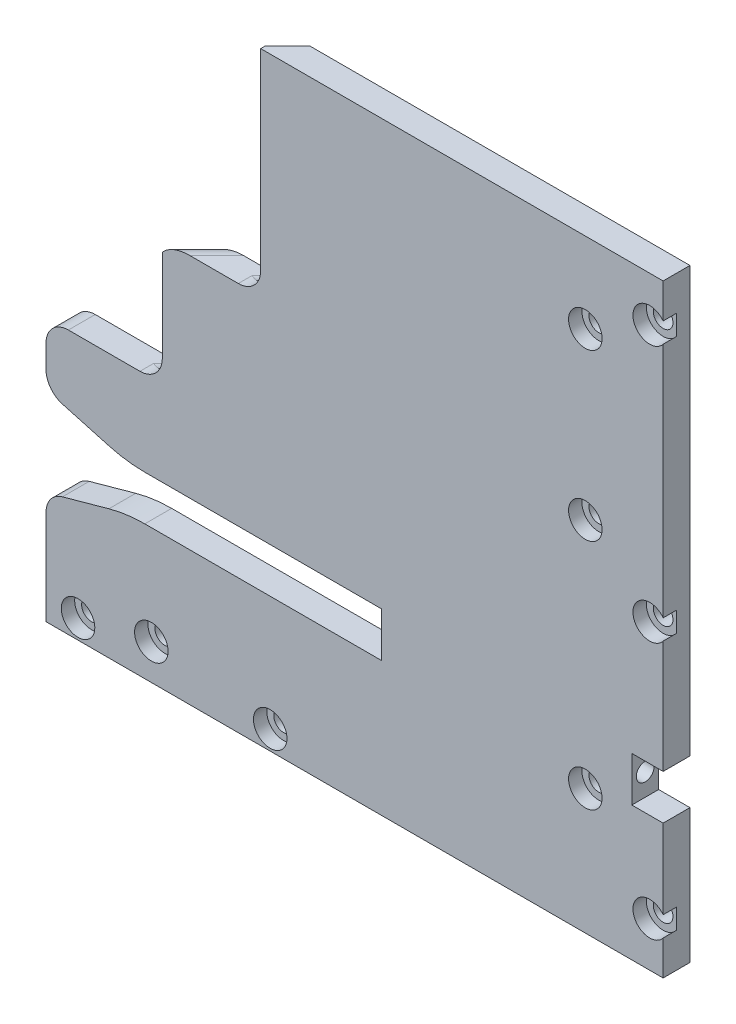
ISO-10303-21;
HEADER;
FILE_DESCRIPTION(('STEP AP214'),'2;1');
FILE_NAME('part.step','',(''),(''),'','','');
FILE_SCHEMA(('AUTOMOTIVE_DESIGN { 1 0 10303 214 1 1 1 1 }'));
ENDSEC;
DATA;
#1=APPLICATION_CONTEXT('core data for automotive mechanical design processes');
#2=APPLICATION_PROTOCOL_DEFINITION('international standard','automotive_design',2000,#1);
#3=PRODUCT_CONTEXT('',#1,'mechanical');
#4=PRODUCT('Part','Part','',(#3));
#5=PRODUCT_RELATED_PRODUCT_CATEGORY('part','',(#4));
#6=PRODUCT_DEFINITION_FORMATION('','',#4);
#7=PRODUCT_DEFINITION_CONTEXT('part definition',#1,'design');
#8=PRODUCT_DEFINITION('design','',#6,#7);
#9=PRODUCT_DEFINITION_SHAPE('','',#8);
#10=(LENGTH_UNIT() NAMED_UNIT(*) SI_UNIT(.MILLI.,.METRE.));
#11=(NAMED_UNIT(*) PLANE_ANGLE_UNIT() SI_UNIT($,.RADIAN.));
#12=(NAMED_UNIT(*) SI_UNIT($,.STERADIAN.) SOLID_ANGLE_UNIT());
#13=UNCERTAINTY_MEASURE_WITH_UNIT(LENGTH_MEASURE(1.E-05),#10,'distance_accuracy_value','');
#14=(GEOMETRIC_REPRESENTATION_CONTEXT(3) GLOBAL_UNCERTAINTY_ASSIGNED_CONTEXT((#13)) GLOBAL_UNIT_ASSIGNED_CONTEXT((#10,
#11,#12)) REPRESENTATION_CONTEXT('',''));
#15=CARTESIAN_POINT('',(0.,0.,0.));
#16=DIRECTION('',(0.,0.,1.));
#17=DIRECTION('',(1.,0.,0.));
#18=AXIS2_PLACEMENT_3D('',#15,#16,#17);
#19=CARTESIAN_POINT('',(0.,0.,6.));
#20=DIRECTION('',(0.,0.,-1.));
#21=DIRECTION('',(-1.,0.,0.));
#22=AXIS2_PLACEMENT_3D('',#19,#20,#21);
#23=PLANE('',#22);
#24=CARTESIAN_POINT('',(-130.844995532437,4.29359135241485,6.));
#25=DIRECTION('',(0.,0.,1.));
#26=DIRECTION('',(1.,0.,0.));
#27=AXIS2_PLACEMENT_3D('',#24,#25,#26);
#28=CIRCLE('',#27,3.75);
#29=CARTESIAN_POINT('',(-127.094995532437,4.29359135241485,6.));
#30=VERTEX_POINT('',#29);
#31=EDGE_CURVE('E764',#30,#30,#28,.T.);
#32=ORIENTED_EDGE('',*,*,#31,.F.);
#33=EDGE_LOOP('',(#32));
#34=FACE_BOUND('',#33,.T.);
#35=CARTESIAN_POINT('',(-114.451398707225,7.9068883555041,6.));
#36=DIRECTION('',(0.,0.,1.));
#37=DIRECTION('',(1.,0.,0.));
#38=AXIS2_PLACEMENT_3D('',#35,#36,#37);
#39=CIRCLE('',#38,3.75000000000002);
#40=CARTESIAN_POINT('',(-110.701398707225,7.9068883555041,6.));
#41=VERTEX_POINT('',#40);
#42=EDGE_CURVE('E752',#41,#41,#39,.T.);
#43=ORIENTED_EDGE('',*,*,#42,.F.);
#44=EDGE_LOOP('',(#43));
#45=FACE_BOUND('',#44,.T.);
#46=CARTESIAN_POINT('',(-87.8703537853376,4.29359135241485,6.));
#47=DIRECTION('',(0.,0.,1.));
#48=DIRECTION('',(1.,0.,0.));
#49=AXIS2_PLACEMENT_3D('',#46,#47,#48);
#50=CIRCLE('',#49,3.75000000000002);
#51=CARTESIAN_POINT('',(-84.1203537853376,4.29359135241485,6.));
#52=VERTEX_POINT('',#51);
#53=EDGE_CURVE('E740',#52,#52,#50,.T.);
#54=ORIENTED_EDGE('',*,*,#53,.F.);
#55=EDGE_LOOP('',(#54));
#56=FACE_BOUND('',#55,.T.);
#57=CARTESIAN_POINT('',(-17.4,117.,6.));
#58=DIRECTION('',(0.,0.,1.));
#59=DIRECTION('',(1.,0.,0.));
#60=AXIS2_PLACEMENT_3D('',#57,#58,#59);
#61=CIRCLE('',#60,3.75000000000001);
#62=CARTESIAN_POINT('',(-13.65,117.,6.));
#63=VERTEX_POINT('',#62);
#64=EDGE_CURVE('E689',#63,#63,#61,.T.);
#65=ORIENTED_EDGE('',*,*,#64,.F.);
#66=EDGE_LOOP('',(#65));
#67=FACE_BOUND('',#66,.T.);
#68=CARTESIAN_POINT('',(-17.4,80.,6.));
#69=DIRECTION('',(0.,0.,1.));
#70=DIRECTION('',(1.,0.,0.));
#71=AXIS2_PLACEMENT_3D('',#68,#69,#70);
#72=CIRCLE('',#71,3.75000000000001);
#73=CARTESIAN_POINT('',(-13.65,80.,6.));
#74=VERTEX_POINT('',#73);
#75=EDGE_CURVE('E677',#74,#74,#72,.T.);
#76=ORIENTED_EDGE('',*,*,#75,.F.);
#77=EDGE_LOOP('',(#76));
#78=FACE_BOUND('',#77,.T.);
#79=CARTESIAN_POINT('',(-17.4,28.,6.));
#80=DIRECTION('',(0.,0.,1.));
#81=DIRECTION('',(1.,0.,0.));
#82=AXIS2_PLACEMENT_3D('',#79,#80,#81);
#83=CIRCLE('',#82,3.75000000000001);
#84=CARTESIAN_POINT('',(-13.65,28.,6.));
#85=VERTEX_POINT('',#84);
#86=EDGE_CURVE('E665',#85,#85,#83,.T.);
#87=ORIENTED_EDGE('',*,*,#86,.F.);
#88=EDGE_LOOP('',(#87));
#89=FACE_BOUND('',#88,.T.);
#90=DIRECTION('',(-1.,0.,0.));
#91=VECTOR('',#90,1.);
#92=CARTESIAN_POINT('',(-112.,87.,6.));
#93=LINE('',#92,#91);
#94=CARTESIAN_POINT('',(-95.,87.,6.));
#95=VERTEX_POINT('',#94);
#96=CARTESIAN_POINT('',(-105.928932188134,87.,6.));
#97=VERTEX_POINT('',#96);
#98=EDGE_CURVE('E304',#95,#97,#93,.T.);
#99=ORIENTED_EDGE('',*,*,#98,.T.);
#100=CARTESIAN_POINT('',(-105.928932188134,82.,6.));
#101=DIRECTION('',(0.,0.,-1.));
#102=DIRECTION('',(1.,0.,0.));
#103=AXIS2_PLACEMENT_3D('',#100,#101,#102);
#104=ELLIPSE('',#103,7.07106781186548,5.);
#105=CARTESIAN_POINT('',(-112.,84.5634094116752,6.));
#106=VERTEX_POINT('',#105);
#107=EDGE_CURVE('E476',#97,#106,#104,.F.);
#108=ORIENTED_EDGE('',*,*,#107,.T.);
#109=DIRECTION('',(0.,-1.,0.));
#110=VECTOR('',#109,1.);
#111=CARTESIAN_POINT('',(-112.,59.,6.));
#112=LINE('',#111,#110);
#113=CARTESIAN_POINT('',(-112.,64.,6.));
#114=VERTEX_POINT('',#113);
#115=EDGE_CURVE('E308',#106,#114,#112,.T.);
#116=ORIENTED_EDGE('',*,*,#115,.T.);
#117=CARTESIAN_POINT('',(-117.,64.,6.));
#118=DIRECTION('',(0.,0.,-1.));
#119=DIRECTION('',(-1.,0.,0.));
#120=AXIS2_PLACEMENT_3D('',#117,#118,#119);
#121=CIRCLE('',#120,5.);
#122=CARTESIAN_POINT('',(-117.,59.,6.));
#123=VERTEX_POINT('',#122);
#124=EDGE_CURVE('E465',#114,#123,#121,.T.);
#125=ORIENTED_EDGE('',*,*,#124,.T.);
#126=DIRECTION('',(-1.,0.,0.));
#127=VECTOR('',#126,1.);
#128=CARTESIAN_POINT('',(-138.,59.,6.));
#129=LINE('',#128,#127);
#130=CARTESIAN_POINT('',(-133.,59.,6.));
#131=VERTEX_POINT('',#130);
#132=EDGE_CURVE('E310',#123,#131,#129,.T.);
#133=ORIENTED_EDGE('',*,*,#132,.T.);
#134=CARTESIAN_POINT('',(-133.,54.,6.));
#135=DIRECTION('',(0.,0.,-1.));
#136=DIRECTION('',(-1.,0.,0.));
#137=AXIS2_PLACEMENT_3D('',#134,#135,#136);
#138=CIRCLE('',#137,5.);
#139=CARTESIAN_POINT('',(-138.,54.,6.));
#140=VERTEX_POINT('',#139);
#141=EDGE_CURVE('E419',#131,#140,#138,.F.);
#142=ORIENTED_EDGE('',*,*,#141,.T.);
#143=DIRECTION('',(0.,-1.,0.));
#144=VECTOR('',#143,1.);
#145=CARTESIAN_POINT('',(-138.,40.,6.));
#146=LINE('',#145,#144);
#147=CARTESIAN_POINT('',(-138.,48.8004282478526,6.));
#148=VERTEX_POINT('',#147);
#149=EDGE_CURVE('E312',#140,#148,#146,.T.);
#150=ORIENTED_EDGE('',*,*,#149,.T.);
#151=CARTESIAN_POINT('',(-133.,48.8004282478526,6.));
#152=DIRECTION('',(0.,0.,-1.));
#153=DIRECTION('',(-1.,0.,0.));
#154=AXIS2_PLACEMENT_3D('',#151,#152,#153);
#155=CIRCLE('',#154,5.);
#156=CARTESIAN_POINT('',(-134.33821931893,43.9828386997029,6.));
#157=VERTEX_POINT('',#156);
#158=EDGE_CURVE('E415',#148,#157,#155,.F.);
#159=ORIENTED_EDGE('',*,*,#158,.T.);
#160=DIRECTION('',(0.963517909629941,-0.267643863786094,0.));
#161=VECTOR('',#160,1.);
#162=CARTESIAN_POINT('',(-120.,40.,6.));
#163=LINE('',#162,#161);
#164=CARTESIAN_POINT('',(-123.940065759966,41.0944627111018,6.));
#165=VERTEX_POINT('',#164);
#166=EDGE_CURVE('E614',#157,#165,#163,.T.);
#167=ORIENTED_EDGE('',*,*,#166,.T.);
#168=CARTESIAN_POINT('',(-115.910749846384,70.,6.));
#169=DIRECTION('',(0.,0.,-1.));
#170=DIRECTION('',(-1.,0.,0.));
#171=AXIS2_PLACEMENT_3D('',#168,#169,#170);
#172=CIRCLE('',#171,30.);
#173=CARTESIAN_POINT('',(-115.910749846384,40.,6.));
#174=VERTEX_POINT('',#173);
#175=EDGE_CURVE('E382',#165,#174,#172,.F.);
#176=ORIENTED_EDGE('',*,*,#175,.T.);
#177=DIRECTION('',(1.,0.,0.));
#178=VECTOR('',#177,1.);
#179=CARTESIAN_POINT('',(-63.,40.,6.));
#180=LINE('',#179,#178);
#181=CARTESIAN_POINT('',(-63.,40.,6.));
#182=VERTEX_POINT('',#181);
#183=EDGE_CURVE('E315',#174,#182,#180,.T.);
#184=ORIENTED_EDGE('',*,*,#183,.T.);
#185=DIRECTION('',(0.,-1.,0.));
#186=VECTOR('',#185,1.);
#187=CARTESIAN_POINT('',(-63.,30.,6.));
#188=LINE('',#187,#186);
#189=CARTESIAN_POINT('',(-63.,30.,6.));
#190=VERTEX_POINT('',#189);
#191=EDGE_CURVE('E317',#182,#190,#188,.T.);
#192=ORIENTED_EDGE('',*,*,#191,.T.);
#193=DIRECTION('',(-1.,0.,0.));
#194=VECTOR('',#193,1.);
#195=CARTESIAN_POINT('',(-138.,30.,6.));
#196=LINE('',#195,#194);
#197=CARTESIAN_POINT('',(-115.910749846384,30.,6.));
#198=VERTEX_POINT('',#197);
#199=EDGE_CURVE('E319',#190,#198,#196,.T.);
#200=ORIENTED_EDGE('',*,*,#199,.T.);
#201=CARTESIAN_POINT('',(-115.910749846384,0.,6.));
#202=DIRECTION('',(0.,0.,-1.));
#203=DIRECTION('',(-1.,0.,0.));
#204=AXIS2_PLACEMENT_3D('',#201,#202,#203);
#205=CIRCLE('',#204,30.);
#206=CARTESIAN_POINT('',(-123.940065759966,28.9055372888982,6.));
#207=VERTEX_POINT('',#206);
#208=EDGE_CURVE('E380',#198,#207,#205,.F.);
#209=ORIENTED_EDGE('',*,*,#208,.T.);
#210=DIRECTION('',(-0.963517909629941,-0.267643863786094,0.));
#211=VECTOR('',#210,1.);
#212=CARTESIAN_POINT('',(-138.,25.,6.));
#213=LINE('',#212,#211);
#214=CARTESIAN_POINT('',(-134.33821931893,26.0171613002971,6.));
#215=VERTEX_POINT('',#214);
#216=EDGE_CURVE('E622',#207,#215,#213,.T.);
#217=ORIENTED_EDGE('',*,*,#216,.T.);
#218=CARTESIAN_POINT('',(-133.,21.1995717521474,6.));
#219=DIRECTION('',(0.,0.,-1.));
#220=DIRECTION('',(-1.,0.,0.));
#221=AXIS2_PLACEMENT_3D('',#218,#219,#220);
#222=CIRCLE('',#221,5.);
#223=CARTESIAN_POINT('',(-138.,21.1995717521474,6.));
#224=VERTEX_POINT('',#223);
#225=EDGE_CURVE('E417',#215,#224,#222,.F.);
#226=ORIENTED_EDGE('',*,*,#225,.T.);
#227=DIRECTION('',(0.,-1.,0.));
#228=VECTOR('',#227,1.);
#229=CARTESIAN_POINT('',(-138.,0.,6.));
#230=LINE('',#229,#228);
#231=CARTESIAN_POINT('',(-138.,0.,6.));
#232=VERTEX_POINT('',#231);
#233=EDGE_CURVE('E322',#224,#232,#230,.T.);
#234=ORIENTED_EDGE('',*,*,#233,.T.);
#235=DIRECTION('',(1.,0.,0.));
#236=VECTOR('',#235,1.);
#237=CARTESIAN_POINT('',(0.,0.,6.));
#238=LINE('',#237,#236);
#239=CARTESIAN_POINT('',(0.,0.,6.));
#240=VERTEX_POINT('',#239);
#241=EDGE_CURVE('E324',#232,#240,#238,.T.);
#242=ORIENTED_EDGE('',*,*,#241,.T.);
#243=DIRECTION('',(0.,1.,0.));
#244=VECTOR('',#243,1.);
#245=CARTESIAN_POINT('',(0.,135.,6.));
#246=LINE('',#245,#244);
#247=CARTESIAN_POINT('',(0.,7.74999999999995,6.));
#248=VERTEX_POINT('',#247);
#249=EDGE_CURVE('E289',#240,#248,#246,.T.);
#250=ORIENTED_EDGE('',*,*,#249,.T.);
#251=CARTESIAN_POINT('',(-3.,9.99999999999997,6.));
#252=DIRECTION('',(0.,0.,1.));
#253=DIRECTION('',(1.,0.,0.));
#254=AXIS2_PLACEMENT_3D('',#251,#252,#253);
#255=CIRCLE('',#254,3.75000000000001);
#256=CARTESIAN_POINT('',(0.,12.25,6.));
#257=VERTEX_POINT('',#256);
#258=EDGE_CURVE('E707',#257,#248,#255,.T.);
#259=ORIENTED_EDGE('',*,*,#258,.F.);
#260=CARTESIAN_POINT('',(0.,30.,6.));
#261=VERTEX_POINT('',#260);
#262=EDGE_CURVE('E288',#257,#261,#246,.T.);
#263=ORIENTED_EDGE('',*,*,#262,.T.);
#264=DIRECTION('',(1.,0.,0.));
#265=VECTOR('',#264,1.);
#266=CARTESIAN_POINT('',(0.,30.,6.));
#267=LINE('',#266,#265);
#268=CARTESIAN_POINT('',(-6.99999999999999,30.,6.));
#269=VERTEX_POINT('',#268);
#270=EDGE_CURVE('E640',#269,#261,#267,.T.);
#271=ORIENTED_EDGE('',*,*,#270,.F.);
#272=DIRECTION('',(0.,-1.,0.));
#273=VECTOR('',#272,1.);
#274=CARTESIAN_POINT('',(-7.,40.,6.));
#275=LINE('',#274,#273);
#276=CARTESIAN_POINT('',(-7.,40.,6.));
#277=VERTEX_POINT('',#276);
#278=EDGE_CURVE('E643',#277,#269,#275,.T.);
#279=ORIENTED_EDGE('',*,*,#278,.F.);
#280=DIRECTION('',(-1.,0.,0.));
#281=VECTOR('',#280,1.);
#282=CARTESIAN_POINT('',(0.,40.,6.));
#283=LINE('',#282,#281);
#284=CARTESIAN_POINT('',(0.,40.,6.));
#285=VERTEX_POINT('',#284);
#286=EDGE_CURVE('E646',#285,#277,#283,.T.);
#287=ORIENTED_EDGE('',*,*,#286,.F.);
#288=CARTESIAN_POINT('',(0.,65.25,6.));
#289=VERTEX_POINT('',#288);
#290=EDGE_CURVE('E285',#285,#289,#246,.T.);
#291=ORIENTED_EDGE('',*,*,#290,.T.);
#292=CARTESIAN_POINT('',(-3.,67.5,6.));
#293=DIRECTION('',(0.,0.,1.));
#294=DIRECTION('',(1.,0.,0.));
#295=AXIS2_PLACEMENT_3D('',#292,#293,#294);
#296=CIRCLE('',#295,3.75000000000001);
#297=CARTESIAN_POINT('',(0.,69.75,6.));
#298=VERTEX_POINT('',#297);
#299=EDGE_CURVE('E280',#298,#289,#296,.T.);
#300=ORIENTED_EDGE('',*,*,#299,.F.);
#301=CARTESIAN_POINT('',(0.,122.75,6.));
#302=VERTEX_POINT('',#301);
#303=EDGE_CURVE('E278',#298,#302,#246,.T.);
#304=ORIENTED_EDGE('',*,*,#303,.T.);
#305=CARTESIAN_POINT('',(-3.,125.,6.));
#306=DIRECTION('',(0.,0.,1.));
#307=DIRECTION('',(1.,0.,0.));
#308=AXIS2_PLACEMENT_3D('',#305,#306,#307);
#309=CIRCLE('',#308,3.75000000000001);
#310=CARTESIAN_POINT('',(0.,127.25,6.));
#311=VERTEX_POINT('',#310);
#312=EDGE_CURVE('E259',#311,#302,#309,.T.);
#313=ORIENTED_EDGE('',*,*,#312,.F.);
#314=CARTESIAN_POINT('',(0.,135.,6.));
#315=VERTEX_POINT('',#314);
#316=EDGE_CURVE('E286',#311,#315,#246,.T.);
#317=ORIENTED_EDGE('',*,*,#316,.T.);
#318=DIRECTION('',(-1.,0.,0.));
#319=VECTOR('',#318,1.);
#320=CARTESIAN_POINT('',(-90.,135.,6.));
#321=LINE('',#320,#319);
#322=CARTESIAN_POINT('',(-90.,135.,6.));
#323=VERTEX_POINT('',#322);
#324=EDGE_CURVE('E298',#315,#323,#321,.T.);
#325=ORIENTED_EDGE('',*,*,#324,.T.);
#326=DIRECTION('',(0.,-1.,0.));
#327=VECTOR('',#326,1.);
#328=CARTESIAN_POINT('',(-90.,87.,6.));
#329=LINE('',#328,#327);
#330=CARTESIAN_POINT('',(-90.,92.,6.));
#331=VERTEX_POINT('',#330);
#332=EDGE_CURVE('E300',#323,#331,#329,.T.);
#333=ORIENTED_EDGE('',*,*,#332,.T.);
#334=CARTESIAN_POINT('',(-95.,92.,6.));
#335=DIRECTION('',(0.,0.,-1.));
#336=DIRECTION('',(-1.,0.,0.));
#337=AXIS2_PLACEMENT_3D('',#334,#335,#336);
#338=CIRCLE('',#337,5.);
#339=EDGE_CURVE('E461',#331,#95,#338,.T.);
#340=ORIENTED_EDGE('',*,*,#339,.T.);
#341=EDGE_LOOP('',(#99,#108,#116,#125,#133,#142,#150,#159,#167,#176,#184,#192,#200,#209,#217,
#226,#234,#242,#250,#259,#263,#271,#279,#287,#291,#300,#304,#313,#317,#325,#333,#340));
#342=FACE_BOUND('',#341,.T.);
#343=ADVANCED_FACE('F33',(#34,#45,#56,#67,#78,#89,#342),#23,.F.);
#344=CARTESIAN_POINT('',(0.,135.,6.));
#345=DIRECTION('',(-1.,0.,0.));
#346=DIRECTION('',(0.,-1.,0.));
#347=AXIS2_PLACEMENT_3D('',#344,#345,#346);
#348=PLANE('',#347);
#349=DIRECTION('',(0.,-1.,0.));
#350=VECTOR('',#349,1.);
#351=CARTESIAN_POINT('',(0.,135.,3.));
#352=LINE('',#351,#350);
#353=CARTESIAN_POINT('',(0.,12.25,3.));
#354=VERTEX_POINT('',#353);
#355=CARTESIAN_POINT('',(0.,7.74999999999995,3.));
#356=VERTEX_POINT('',#355);
#357=EDGE_CURVE('E429',#354,#356,#352,.T.);
#358=ORIENTED_EDGE('',*,*,#357,.T.);
#359=DIRECTION('',(0.,0.,1.));
#360=VECTOR('',#359,1.);
#361=CARTESIAN_POINT('',(0.,7.74999999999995,6.));
#362=LINE('',#361,#360);
#363=EDGE_CURVE('E692',#356,#248,#362,.T.);
#364=ORIENTED_EDGE('',*,*,#363,.T.);
#365=ORIENTED_EDGE('',*,*,#249,.F.);
#366=DIRECTION('',(0.,0.,-1.));
#367=VECTOR('',#366,1.);
#368=CARTESIAN_POINT('',(0.,0.,6.));
#369=LINE('',#368,#367);
#370=CARTESIAN_POINT('',(0.,0.,0.));
#371=VERTEX_POINT('',#370);
#372=EDGE_CURVE('E326',#240,#371,#369,.T.);
#373=ORIENTED_EDGE('',*,*,#372,.T.);
#374=DIRECTION('',(0.,1.,0.));
#375=VECTOR('',#374,1.);
#376=CARTESIAN_POINT('',(0.,135.,0.));
#377=LINE('',#376,#375);
#378=CARTESIAN_POINT('',(0.,30.,0.));
#379=VERTEX_POINT('',#378);
#380=EDGE_CURVE('E327',#371,#379,#377,.T.);
#381=ORIENTED_EDGE('',*,*,#380,.T.);
#382=DIRECTION('',(0.,0.,1.));
#383=VECTOR('',#382,1.);
#384=CARTESIAN_POINT('',(0.,30.,0.));
#385=LINE('',#384,#383);
#386=EDGE_CURVE('E434',#379,#261,#385,.T.);
#387=ORIENTED_EDGE('',*,*,#386,.T.);
#388=ORIENTED_EDGE('',*,*,#262,.F.);
#389=DIRECTION('',(0.,0.,1.));
#390=VECTOR('',#389,1.);
#391=CARTESIAN_POINT('',(0.,12.25,6.));
#392=LINE('',#391,#390);
#393=EDGE_CURVE('E695',#257,#354,#392,.F.);
#394=ORIENTED_EDGE('',*,*,#393,.T.);
#395=EDGE_LOOP('',(#358,#364,#365,#373,#381,#387,#388,#394));
#396=FACE_BOUND('',#395,.T.);
#397=ADVANCED_FACE('F525',(#396),#348,.F.);
#398=DIRECTION('',(0.,-1.,0.));
#399=VECTOR('',#398,1.);
#400=CARTESIAN_POINT('',(0.,135.,3.));
#401=LINE('',#400,#399);
#402=CARTESIAN_POINT('',(0.,127.25,3.));
#403=VERTEX_POINT('',#402);
#404=CARTESIAN_POINT('',(0.,122.75,3.));
#405=VERTEX_POINT('',#404);
#406=EDGE_CURVE('E279',#403,#405,#401,.T.);
#407=ORIENTED_EDGE('',*,*,#406,.T.);
#408=DIRECTION('',(0.,0.,1.));
#409=VECTOR('',#408,1.);
#410=CARTESIAN_POINT('',(0.,122.75,6.));
#411=LINE('',#410,#409);
#412=EDGE_CURVE('E263',#405,#302,#411,.T.);
#413=ORIENTED_EDGE('',*,*,#412,.T.);
#414=ORIENTED_EDGE('',*,*,#303,.F.);
#415=DIRECTION('',(0.,0.,1.));
#416=VECTOR('',#415,1.);
#417=CARTESIAN_POINT('',(0.,69.75,6.));
#418=LINE('',#417,#416);
#419=CARTESIAN_POINT('',(0.,69.75,3.));
#420=VERTEX_POINT('',#419);
#421=EDGE_CURVE('E712',#298,#420,#418,.F.);
#422=ORIENTED_EDGE('',*,*,#421,.T.);
#423=DIRECTION('',(0.,-1.,0.));
#424=VECTOR('',#423,1.);
#425=CARTESIAN_POINT('',(0.,135.,3.));
#426=LINE('',#425,#424);
#427=CARTESIAN_POINT('',(0.,65.25,3.));
#428=VERTEX_POINT('',#427);
#429=EDGE_CURVE('E437',#420,#428,#426,.T.);
#430=ORIENTED_EDGE('',*,*,#429,.T.);
#431=DIRECTION('',(0.,0.,1.));
#432=VECTOR('',#431,1.);
#433=CARTESIAN_POINT('',(0.,65.25,6.));
#434=LINE('',#433,#432);
#435=EDGE_CURVE('E709',#428,#289,#434,.T.);
#436=ORIENTED_EDGE('',*,*,#435,.T.);
#437=ORIENTED_EDGE('',*,*,#290,.F.);
#438=DIRECTION('',(0.,0.,1.));
#439=VECTOR('',#438,1.);
#440=CARTESIAN_POINT('',(0.,40.,0.));
#441=LINE('',#440,#439);
#442=CARTESIAN_POINT('',(0.,40.,0.));
#443=VERTEX_POINT('',#442);
#444=EDGE_CURVE('E631',#443,#285,#441,.T.);
#445=ORIENTED_EDGE('',*,*,#444,.F.);
#446=CARTESIAN_POINT('',(0.,135.,0.));
#447=VERTEX_POINT('',#446);
#448=EDGE_CURVE('E331',#443,#447,#377,.T.);
#449=ORIENTED_EDGE('',*,*,#448,.T.);
#450=DIRECTION('',(0.,0.,-1.));
#451=VECTOR('',#450,1.);
#452=CARTESIAN_POINT('',(0.,135.,6.));
#453=LINE('',#452,#451);
#454=EDGE_CURVE('E366',#315,#447,#453,.T.);
#455=ORIENTED_EDGE('',*,*,#454,.F.);
#456=ORIENTED_EDGE('',*,*,#316,.F.);
#457=DIRECTION('',(0.,0.,1.));
#458=VECTOR('',#457,1.);
#459=CARTESIAN_POINT('',(0.,127.25,6.));
#460=LINE('',#459,#458);
#461=EDGE_CURVE('E266',#311,#403,#460,.F.);
#462=ORIENTED_EDGE('',*,*,#461,.T.);
#463=EDGE_LOOP('',(#407,#413,#414,#422,#430,#436,#437,#445,#449,#455,#456,#462));
#464=FACE_BOUND('',#463,.T.);
#465=ADVANCED_FACE('F276',(#464),#348,.F.);
#466=CARTESIAN_POINT('',(-90.,135.,6.));
#467=DIRECTION('',(0.,-1.,0.));
#468=DIRECTION('',(0.,0.,-1.));
#469=AXIS2_PLACEMENT_3D('',#466,#467,#468);
#470=PLANE('',#469);
#471=DIRECTION('',(-1.,0.,0.));
#472=VECTOR('',#471,1.);
#473=CARTESIAN_POINT('',(-90.,135.,0.));
#474=LINE('',#473,#472);
#475=CARTESIAN_POINT('',(-85.,135.,0.));
#476=VERTEX_POINT('',#475);
#477=EDGE_CURVE('E330',#447,#476,#474,.T.);
#478=ORIENTED_EDGE('',*,*,#477,.T.);
#479=DIRECTION('',(-0.707106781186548,0.,0.707106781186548));
#480=VECTOR('',#479,1.);
#481=CARTESIAN_POINT('',(-90.,135.,5.00000000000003));
#482=LINE('',#481,#480);
#483=CARTESIAN_POINT('',(-90.,135.,5.00000000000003));
#484=VERTEX_POINT('',#483);
#485=EDGE_CURVE('E398',#476,#484,#482,.T.);
#486=ORIENTED_EDGE('',*,*,#485,.T.);
#487=DIRECTION('',(0.,0.,-1.));
#488=VECTOR('',#487,1.);
#489=CARTESIAN_POINT('',(-90.,135.,6.));
#490=LINE('',#489,#488);
#491=EDGE_CURVE('E363',#323,#484,#490,.T.);
#492=ORIENTED_EDGE('',*,*,#491,.F.);
#493=ORIENTED_EDGE('',*,*,#324,.F.);
#494=ORIENTED_EDGE('',*,*,#454,.T.);
#495=EDGE_LOOP('',(#478,#486,#492,#493,#494));
#496=FACE_BOUND('',#495,.T.);
#497=ADVANCED_FACE('F504',(#496),#470,.F.);
#498=CARTESIAN_POINT('',(-90.,87.,6.));
#499=DIRECTION('',(1.,0.,0.));
#500=DIRECTION('',(0.,0.,-1.));
#501=AXIS2_PLACEMENT_3D('',#498,#499,#500);
#502=PLANE('',#501);
#503=DIRECTION('',(0.,-1.,0.));
#504=VECTOR('',#503,1.);
#505=CARTESIAN_POINT('',(-90.,87.,5.00000000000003));
#506=LINE('',#505,#504);
#507=CARTESIAN_POINT('',(-90.,92.,5.00000000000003));
#508=VERTEX_POINT('',#507);
#509=EDGE_CURVE('E395',#484,#508,#506,.T.);
#510=ORIENTED_EDGE('',*,*,#509,.T.);
#511=DIRECTION('',(0.,0.,-1.));
#512=VECTOR('',#511,1.);
#513=CARTESIAN_POINT('',(-90.,92.,6.));
#514=LINE('',#513,#512);
#515=EDGE_CURVE('E446',#508,#331,#514,.F.);
#516=ORIENTED_EDGE('',*,*,#515,.T.);
#517=ORIENTED_EDGE('',*,*,#332,.F.);
#518=ORIENTED_EDGE('',*,*,#491,.T.);
#519=EDGE_LOOP('',(#510,#516,#517,#518));
#520=FACE_BOUND('',#519,.T.);
#521=ADVANCED_FACE('F507',(#520),#502,.F.);
#522=CARTESIAN_POINT('',(-112.,87.,6.));
#523=DIRECTION('',(0.,-1.,0.));
#524=DIRECTION('',(1.,0.,0.));
#525=AXIS2_PLACEMENT_3D('',#522,#523,#524);
#526=PLANE('',#525);
#527=DIRECTION('',(-1.,0.,0.));
#528=VECTOR('',#527,1.);
#529=CARTESIAN_POINT('',(-112.,87.,0.));
#530=LINE('',#529,#528);
#531=CARTESIAN_POINT('',(-92.0710678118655,87.,0.));
#532=VERTEX_POINT('',#531);
#533=CARTESIAN_POINT('',(-99.9289321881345,87.,0.));
#534=VERTEX_POINT('',#533);
#535=EDGE_CURVE('E334',#532,#534,#530,.T.);
#536=ORIENTED_EDGE('',*,*,#535,.T.);
#537=DIRECTION('',(-0.707106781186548,0.,0.707106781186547));
#538=VECTOR('',#537,1.);
#539=CARTESIAN_POINT('',(-108.464466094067,87.,8.53553390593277));
#540=LINE('',#539,#538);
#541=EDGE_CURVE('E469',#534,#97,#540,.T.);
#542=ORIENTED_EDGE('',*,*,#541,.T.);
#543=ORIENTED_EDGE('',*,*,#98,.F.);
#544=DIRECTION('',(0.,0.,-1.));
#545=VECTOR('',#544,1.);
#546=CARTESIAN_POINT('',(-95.,87.,5.00000000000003));
#547=LINE('',#546,#545);
#548=CARTESIAN_POINT('',(-95.,87.,2.92893218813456));
#549=VERTEX_POINT('',#548);
#550=EDGE_CURVE('E443',#95,#549,#547,.T.);
#551=ORIENTED_EDGE('',*,*,#550,.T.);
#552=DIRECTION('',(0.707106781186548,0.,-0.707106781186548));
#553=VECTOR('',#552,1.);
#554=CARTESIAN_POINT('',(-105.035533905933,87.,12.9644660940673));
#555=LINE('',#554,#553);
#556=EDGE_CURVE('E441',#549,#532,#555,.T.);
#557=ORIENTED_EDGE('',*,*,#556,.T.);
#558=EDGE_LOOP('',(#536,#542,#543,#551,#557));
#559=FACE_BOUND('',#558,.T.);
#560=ADVANCED_FACE('F490',(#559),#526,.F.);
#561=CARTESIAN_POINT('',(-112.,59.,6.));
#562=DIRECTION('',(1.,0.,0.));
#563=DIRECTION('',(0.,1.,0.));
#564=AXIS2_PLACEMENT_3D('',#561,#562,#563);
#565=PLANE('',#564);
#566=ORIENTED_EDGE('',*,*,#115,.F.);
#567=CARTESIAN_POINT('',(-112.,82.,12.0710678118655));
#568=DIRECTION('',(1.,0.,0.));
#569=DIRECTION('',(0.,0.,-1.));
#570=AXIS2_PLACEMENT_3D('',#567,#568,#569);
#571=ELLIPSE('',#570,7.07106781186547,5.);
#572=CARTESIAN_POINT('',(-112.,82.,5.00000000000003));
#573=VERTEX_POINT('',#572);
#574=EDGE_CURVE('E55',#106,#573,#571,.F.);
#575=ORIENTED_EDGE('',*,*,#574,.T.);
#576=DIRECTION('',(0.,-1.,0.));
#577=VECTOR('',#576,1.);
#578=CARTESIAN_POINT('',(-112.,59.,5.00000000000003));
#579=LINE('',#578,#577);
#580=CARTESIAN_POINT('',(-112.,64.,5.00000000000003));
#581=VERTEX_POINT('',#580);
#582=EDGE_CURVE('E389',#573,#581,#579,.T.);
#583=ORIENTED_EDGE('',*,*,#582,.T.);
#584=DIRECTION('',(0.,0.,-1.));
#585=VECTOR('',#584,1.);
#586=CARTESIAN_POINT('',(-112.,64.,6.));
#587=LINE('',#586,#585);
#588=EDGE_CURVE('E455',#581,#114,#587,.F.);
#589=ORIENTED_EDGE('',*,*,#588,.T.);
#590=EDGE_LOOP('',(#566,#575,#583,#589));
#591=FACE_BOUND('',#590,.T.);
#592=ADVANCED_FACE('F481',(#591),#565,.F.);
#593=CARTESIAN_POINT('',(-138.,59.,6.));
#594=DIRECTION('',(0.,-1.,0.));
#595=DIRECTION('',(1.,0.,0.));
#596=AXIS2_PLACEMENT_3D('',#593,#594,#595);
#597=PLANE('',#596);
#598=ORIENTED_EDGE('',*,*,#132,.F.);
#599=DIRECTION('',(0.,0.,-1.));
#600=VECTOR('',#599,1.);
#601=CARTESIAN_POINT('',(-117.,59.,5.00000000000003));
#602=LINE('',#601,#600);
#603=CARTESIAN_POINT('',(-117.,59.,2.92893218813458));
#604=VERTEX_POINT('',#603);
#605=EDGE_CURVE('E452',#123,#604,#602,.T.);
#606=ORIENTED_EDGE('',*,*,#605,.T.);
#607=DIRECTION('',(0.707106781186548,0.,-0.707106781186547));
#608=VECTOR('',#607,1.);
#609=CARTESIAN_POINT('',(-129.035533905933,59.,14.9644660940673));
#610=LINE('',#609,#608);
#611=CARTESIAN_POINT('',(-114.071067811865,59.,0.));
#612=VERTEX_POINT('',#611);
#613=EDGE_CURVE('E450',#604,#612,#610,.T.);
#614=ORIENTED_EDGE('',*,*,#613,.T.);
#615=DIRECTION('',(-1.,0.,0.));
#616=VECTOR('',#615,1.);
#617=CARTESIAN_POINT('',(-138.,59.,0.));
#618=LINE('',#617,#616);
#619=CARTESIAN_POINT('',(-133.,59.,0.));
#620=VERTEX_POINT('',#619);
#621=EDGE_CURVE('E337',#612,#620,#618,.T.);
#622=ORIENTED_EDGE('',*,*,#621,.T.);
#623=DIRECTION('',(0.,0.,-1.));
#624=VECTOR('',#623,1.);
#625=CARTESIAN_POINT('',(-133.,59.,6.));
#626=LINE('',#625,#624);
#627=EDGE_CURVE('E412',#620,#131,#626,.F.);
#628=ORIENTED_EDGE('',*,*,#627,.T.);
#629=EDGE_LOOP('',(#598,#606,#614,#622,#628));
#630=FACE_BOUND('',#629,.T.);
#631=ADVANCED_FACE('F565',(#630),#597,.F.);
#632=CARTESIAN_POINT('',(-138.,40.,6.));
#633=DIRECTION('',(1.,0.,0.));
#634=DIRECTION('',(0.,0.,-1.));
#635=AXIS2_PLACEMENT_3D('',#632,#633,#634);
#636=PLANE('',#635);
#637=ORIENTED_EDGE('',*,*,#149,.F.);
#638=DIRECTION('',(0.,0.,-1.));
#639=VECTOR('',#638,1.);
#640=CARTESIAN_POINT('',(-138.,54.,6.));
#641=LINE('',#640,#639);
#642=CARTESIAN_POINT('',(-138.,54.,0.));
#643=VERTEX_POINT('',#642);
#644=EDGE_CURVE('E402',#140,#643,#641,.T.);
#645=ORIENTED_EDGE('',*,*,#644,.T.);
#646=DIRECTION('',(0.,-1.,0.));
#647=VECTOR('',#646,1.);
#648=CARTESIAN_POINT('',(-138.,40.,0.));
#649=LINE('',#648,#647);
#650=CARTESIAN_POINT('',(-138.,48.8004282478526,0.));
#651=VERTEX_POINT('',#650);
#652=EDGE_CURVE('E339',#643,#651,#649,.T.);
#653=ORIENTED_EDGE('',*,*,#652,.T.);
#654=DIRECTION('',(0.,0.,-1.));
#655=VECTOR('',#654,1.);
#656=CARTESIAN_POINT('',(-138.,48.8004282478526,6.));
#657=LINE('',#656,#655);
#658=EDGE_CURVE('E400',#651,#148,#657,.F.);
#659=ORIENTED_EDGE('',*,*,#658,.T.);
#660=EDGE_LOOP('',(#637,#645,#653,#659));
#661=FACE_BOUND('',#660,.T.);
#662=ADVANCED_FACE('F561',(#661),#636,.F.);
#663=CARTESIAN_POINT('',(-63.,40.,6.));
#664=DIRECTION('',(0.,1.,0.));
#665=DIRECTION('',(-1.,0.,0.));
#666=AXIS2_PLACEMENT_3D('',#663,#664,#665);
#667=PLANE('',#666);
#668=ORIENTED_EDGE('',*,*,#183,.F.);
#669=DIRECTION('',(0.,0.,-1.));
#670=VECTOR('',#669,1.);
#671=CARTESIAN_POINT('',(-115.910749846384,40.,6.));
#672=LINE('',#671,#670);
#673=CARTESIAN_POINT('',(-115.910749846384,40.,0.));
#674=VERTEX_POINT('',#673);
#675=EDGE_CURVE('E369',#174,#674,#672,.T.);
#676=ORIENTED_EDGE('',*,*,#675,.T.);
#677=DIRECTION('',(1.,0.,0.));
#678=VECTOR('',#677,1.);
#679=CARTESIAN_POINT('',(-63.,40.,0.));
#680=LINE('',#679,#678);
#681=CARTESIAN_POINT('',(-63.,40.,0.));
#682=VERTEX_POINT('',#681);
#683=EDGE_CURVE('E342',#674,#682,#680,.T.);
#684=ORIENTED_EDGE('',*,*,#683,.T.);
#685=DIRECTION('',(0.,0.,-1.));
#686=VECTOR('',#685,1.);
#687=CARTESIAN_POINT('',(-63.,40.,6.));
#688=LINE('',#687,#686);
#689=EDGE_CURVE('E360',#182,#682,#688,.T.);
#690=ORIENTED_EDGE('',*,*,#689,.F.);
#691=EDGE_LOOP('',(#668,#676,#684,#690));
#692=FACE_BOUND('',#691,.T.);
#693=ADVANCED_FACE('F557',(#692),#667,.F.);
#694=CARTESIAN_POINT('',(-63.,30.,6.));
#695=DIRECTION('',(1.,0.,0.));
#696=DIRECTION('',(0.,0.,-1.));
#697=AXIS2_PLACEMENT_3D('',#694,#695,#696);
#698=PLANE('',#697);
#699=CARTESIAN_POINT('',(-63.,35.,3.));
#700=DIRECTION('',(-1.,0.,0.));
#701=DIRECTION('',(0.,0.,1.));
#702=AXIS2_PLACEMENT_3D('',#699,#700,#701);
#703=CIRCLE('',#702,2.);
#704=CARTESIAN_POINT('',(-63.,35.,5.));
#705=VERTEX_POINT('',#704);
#706=EDGE_CURVE('E433',#705,#705,#703,.T.);
#707=ORIENTED_EDGE('',*,*,#706,.F.);
#708=EDGE_LOOP('',(#707));
#709=FACE_BOUND('',#708,.T.);
#710=DIRECTION('',(0.,-1.,0.));
#711=VECTOR('',#710,1.);
#712=CARTESIAN_POINT('',(-63.,30.,0.));
#713=LINE('',#712,#711);
#714=CARTESIAN_POINT('',(-63.,30.,0.));
#715=VERTEX_POINT('',#714);
#716=EDGE_CURVE('E344',#682,#715,#713,.T.);
#717=ORIENTED_EDGE('',*,*,#716,.T.);
#718=DIRECTION('',(0.,0.,-1.));
#719=VECTOR('',#718,1.);
#720=CARTESIAN_POINT('',(-63.,30.,6.));
#721=LINE('',#720,#719);
#722=EDGE_CURVE('E357',#190,#715,#721,.T.);
#723=ORIENTED_EDGE('',*,*,#722,.F.);
#724=ORIENTED_EDGE('',*,*,#191,.F.);
#725=ORIENTED_EDGE('',*,*,#689,.T.);
#726=EDGE_LOOP('',(#717,#723,#724,#725));
#727=FACE_BOUND('',#726,.T.);
#728=ADVANCED_FACE('F553',(#709,#727),#698,.F.);
#729=CARTESIAN_POINT('',(-138.,30.,6.));
#730=DIRECTION('',(0.,-1.,0.));
#731=DIRECTION('',(0.,0.,-1.));
#732=AXIS2_PLACEMENT_3D('',#729,#730,#731);
#733=PLANE('',#732);
#734=DIRECTION('',(-1.,0.,0.));
#735=VECTOR('',#734,1.);
#736=CARTESIAN_POINT('',(-138.,30.,0.));
#737=LINE('',#736,#735);
#738=CARTESIAN_POINT('',(-115.910749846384,30.,0.));
#739=VERTEX_POINT('',#738);
#740=EDGE_CURVE('E346',#715,#739,#737,.T.);
#741=ORIENTED_EDGE('',*,*,#740,.T.);
#742=DIRECTION('',(0.,0.,-1.));
#743=VECTOR('',#742,1.);
#744=CARTESIAN_POINT('',(-115.910749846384,30.,6.));
#745=LINE('',#744,#743);
#746=EDGE_CURVE('E387',#739,#198,#745,.F.);
#747=ORIENTED_EDGE('',*,*,#746,.T.);
#748=ORIENTED_EDGE('',*,*,#199,.F.);
#749=ORIENTED_EDGE('',*,*,#722,.T.);
#750=EDGE_LOOP('',(#741,#747,#748,#749));
#751=FACE_BOUND('',#750,.T.);
#752=ADVANCED_FACE('F549',(#751),#733,.F.);
#753=CARTESIAN_POINT('',(-138.,0.,6.));
#754=DIRECTION('',(1.,0.,0.));
#755=DIRECTION('',(0.,0.,-1.));
#756=AXIS2_PLACEMENT_3D('',#753,#754,#755);
#757=PLANE('',#756);
#758=ORIENTED_EDGE('',*,*,#233,.F.);
#759=DIRECTION('',(0.,0.,-1.));
#760=VECTOR('',#759,1.);
#761=CARTESIAN_POINT('',(-138.,21.1995717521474,6.));
#762=LINE('',#761,#760);
#763=CARTESIAN_POINT('',(-138.,21.1995717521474,0.));
#764=VERTEX_POINT('',#763);
#765=EDGE_CURVE('E421',#224,#764,#762,.T.);
#766=ORIENTED_EDGE('',*,*,#765,.T.);
#767=DIRECTION('',(0.,-1.,0.));
#768=VECTOR('',#767,1.);
#769=CARTESIAN_POINT('',(-138.,0.,0.));
#770=LINE('',#769,#768);
#771=CARTESIAN_POINT('',(-138.,0.,0.));
#772=VERTEX_POINT('',#771);
#773=EDGE_CURVE('E349',#764,#772,#770,.T.);
#774=ORIENTED_EDGE('',*,*,#773,.T.);
#775=DIRECTION('',(0.,0.,-1.));
#776=VECTOR('',#775,1.);
#777=CARTESIAN_POINT('',(-138.,0.,6.));
#778=LINE('',#777,#776);
#779=EDGE_CURVE('E354',#232,#772,#778,.T.);
#780=ORIENTED_EDGE('',*,*,#779,.F.);
#781=EDGE_LOOP('',(#758,#766,#774,#780));
#782=FACE_BOUND('',#781,.T.);
#783=ADVANCED_FACE('F545',(#782),#757,.F.);
#784=CARTESIAN_POINT('',(0.,0.,6.));
#785=DIRECTION('',(0.,1.,0.));
#786=DIRECTION('',(-1.,0.,0.));
#787=AXIS2_PLACEMENT_3D('',#784,#785,#786);
#788=PLANE('',#787);
#789=DIRECTION('',(1.,0.,0.));
#790=VECTOR('',#789,1.);
#791=CARTESIAN_POINT('',(0.,0.,0.));
#792=LINE('',#791,#790);
#793=EDGE_CURVE('E290',#772,#371,#792,.T.);
#794=ORIENTED_EDGE('',*,*,#793,.T.);
#795=ORIENTED_EDGE('',*,*,#372,.F.);
#796=ORIENTED_EDGE('',*,*,#241,.F.);
#797=ORIENTED_EDGE('',*,*,#779,.T.);
#798=EDGE_LOOP('',(#794,#795,#796,#797));
#799=FACE_BOUND('',#798,.T.);
#800=ADVANCED_FACE('F541',(#799),#788,.F.);
#801=CARTESIAN_POINT('',(0.,0.,0.));
#802=DIRECTION('',(0.,0.,-1.));
#803=DIRECTION('',(-1.,0.,0.));
#804=AXIS2_PLACEMENT_3D('',#801,#802,#803);
#805=PLANE('',#804);
#806=CARTESIAN_POINT('',(-130.844995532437,4.29359135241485,0.));
#807=DIRECTION('',(0.,0.,1.));
#808=DIRECTION('',(1.,0.,0.));
#809=AXIS2_PLACEMENT_3D('',#806,#807,#808);
#810=CIRCLE('',#809,2.20000000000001);
#811=CARTESIAN_POINT('',(-128.644995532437,4.29359135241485,0.));
#812=VERTEX_POINT('',#811);
#813=EDGE_CURVE('E755',#812,#812,#810,.T.);
#814=ORIENTED_EDGE('',*,*,#813,.T.);
#815=EDGE_LOOP('',(#814));
#816=FACE_BOUND('',#815,.T.);
#817=CARTESIAN_POINT('',(-114.451398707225,7.9068883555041,0.));
#818=DIRECTION('',(0.,0.,1.));
#819=DIRECTION('',(1.,0.,0.));
#820=AXIS2_PLACEMENT_3D('',#817,#818,#819);
#821=CIRCLE('',#820,2.20000000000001);
#822=CARTESIAN_POINT('',(-112.251398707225,7.9068883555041,0.));
#823=VERTEX_POINT('',#822);
#824=EDGE_CURVE('E743',#823,#823,#821,.T.);
#825=ORIENTED_EDGE('',*,*,#824,.T.);
#826=EDGE_LOOP('',(#825));
#827=FACE_BOUND('',#826,.T.);
#828=CARTESIAN_POINT('',(-87.8703537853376,4.29359135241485,0.));
#829=DIRECTION('',(0.,0.,1.));
#830=DIRECTION('',(1.,0.,0.));
#831=AXIS2_PLACEMENT_3D('',#828,#829,#830);
#832=CIRCLE('',#831,2.20000000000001);
#833=CARTESIAN_POINT('',(-85.6703537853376,4.29359135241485,0.));
#834=VERTEX_POINT('',#833);
#835=EDGE_CURVE('E473',#834,#834,#832,.T.);
#836=ORIENTED_EDGE('',*,*,#835,.T.);
#837=EDGE_LOOP('',(#836));
#838=FACE_BOUND('',#837,.T.);
#839=CARTESIAN_POINT('',(-3.,125.,0.));
#840=DIRECTION('',(0.,0.,1.));
#841=DIRECTION('',(1.,0.,0.));
#842=AXIS2_PLACEMENT_3D('',#839,#840,#841);
#843=CIRCLE('',#842,2.20000000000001);
#844=CARTESIAN_POINT('',(-0.799999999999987,125.,0.));
#845=VERTEX_POINT('',#844);
#846=EDGE_CURVE('E725',#845,#845,#843,.T.);
#847=ORIENTED_EDGE('',*,*,#846,.T.);
#848=EDGE_LOOP('',(#847));
#849=FACE_BOUND('',#848,.T.);
#850=CARTESIAN_POINT('',(-3.,67.5,0.));
#851=DIRECTION('',(0.,0.,1.));
#852=DIRECTION('',(1.,0.,0.));
#853=AXIS2_PLACEMENT_3D('',#850,#851,#852);
#854=CIRCLE('',#853,2.20000000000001);
#855=CARTESIAN_POINT('',(-0.799999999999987,67.5,0.));
#856=VERTEX_POINT('',#855);
#857=EDGE_CURVE('E714',#856,#856,#854,.T.);
#858=ORIENTED_EDGE('',*,*,#857,.T.);
#859=EDGE_LOOP('',(#858));
#860=FACE_BOUND('',#859,.T.);
#861=CARTESIAN_POINT('',(-3.,9.99999999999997,0.));
#862=DIRECTION('',(0.,0.,1.));
#863=DIRECTION('',(1.,0.,0.));
#864=AXIS2_PLACEMENT_3D('',#861,#862,#863);
#865=CIRCLE('',#864,2.20000000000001);
#866=CARTESIAN_POINT('',(-0.79999999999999,9.99999999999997,0.));
#867=VERTEX_POINT('',#866);
#868=EDGE_CURVE('E698',#867,#867,#865,.T.);
#869=ORIENTED_EDGE('',*,*,#868,.T.);
#870=EDGE_LOOP('',(#869));
#871=FACE_BOUND('',#870,.T.);
#872=CARTESIAN_POINT('',(-17.4,117.,0.));
#873=DIRECTION('',(0.,0.,1.));
#874=DIRECTION('',(1.,0.,0.));
#875=AXIS2_PLACEMENT_3D('',#872,#873,#874);
#876=CIRCLE('',#875,2.20000000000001);
#877=CARTESIAN_POINT('',(-15.2,117.,0.));
#878=VERTEX_POINT('',#877);
#879=EDGE_CURVE('E680',#878,#878,#876,.T.);
#880=ORIENTED_EDGE('',*,*,#879,.T.);
#881=EDGE_LOOP('',(#880));
#882=FACE_BOUND('',#881,.T.);
#883=CARTESIAN_POINT('',(-17.4,80.,0.));
#884=DIRECTION('',(0.,0.,1.));
#885=DIRECTION('',(1.,0.,0.));
#886=AXIS2_PLACEMENT_3D('',#883,#884,#885);
#887=CIRCLE('',#886,2.20000000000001);
#888=CARTESIAN_POINT('',(-15.2,80.,0.));
#889=VERTEX_POINT('',#888);
#890=EDGE_CURVE('E668',#889,#889,#887,.T.);
#891=ORIENTED_EDGE('',*,*,#890,.T.);
#892=EDGE_LOOP('',(#891));
#893=FACE_BOUND('',#892,.T.);
#894=CARTESIAN_POINT('',(-17.4,28.,0.));
#895=DIRECTION('',(0.,0.,1.));
#896=DIRECTION('',(1.,0.,0.));
#897=AXIS2_PLACEMENT_3D('',#894,#895,#896);
#898=CIRCLE('',#897,2.20000000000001);
#899=CARTESIAN_POINT('',(-15.2,28.,0.));
#900=VERTEX_POINT('',#899);
#901=EDGE_CURVE('E649',#900,#900,#898,.T.);
#902=ORIENTED_EDGE('',*,*,#901,.T.);
#903=EDGE_LOOP('',(#902));
#904=FACE_BOUND('',#903,.T.);
#905=DIRECTION('',(0.,1.,0.));
#906=VECTOR('',#905,1.);
#907=CARTESIAN_POINT('',(-107.,87.,0.));
#908=LINE('',#907,#906);
#909=CARTESIAN_POINT('',(-107.,64.,0.));
#910=VERTEX_POINT('',#909);
#911=CARTESIAN_POINT('',(-107.,82.,0.));
#912=VERTEX_POINT('',#911);
#913=EDGE_CURVE('E393',#910,#912,#908,.T.);
#914=ORIENTED_EDGE('',*,*,#913,.T.);
#915=CARTESIAN_POINT('',(-99.9289321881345,82.,0.));
#916=DIRECTION('',(0.,0.,-1.));
#917=DIRECTION('',(1.,0.,0.));
#918=AXIS2_PLACEMENT_3D('',#915,#916,#917);
#919=ELLIPSE('',#918,7.07106781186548,5.);
#920=EDGE_CURVE('E11',#912,#534,#919,.T.);
#921=ORIENTED_EDGE('',*,*,#920,.T.);
#922=ORIENTED_EDGE('',*,*,#535,.F.);
#923=CARTESIAN_POINT('',(-92.0710678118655,92.,0.));
#924=DIRECTION('',(0.,0.,-1.));
#925=DIRECTION('',(1.,0.,0.));
#926=AXIS2_PLACEMENT_3D('',#923,#924,#925);
#927=ELLIPSE('',#926,7.07106781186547,5.);
#928=CARTESIAN_POINT('',(-85.,92.,0.));
#929=VERTEX_POINT('',#928);
#930=EDGE_CURVE('E463',#532,#929,#927,.F.);
#931=ORIENTED_EDGE('',*,*,#930,.T.);
#932=DIRECTION('',(0.,1.,0.));
#933=VECTOR('',#932,1.);
#934=CARTESIAN_POINT('',(-85.,135.,0.));
#935=LINE('',#934,#933);
#936=EDGE_CURVE('E391',#929,#476,#935,.T.);
#937=ORIENTED_EDGE('',*,*,#936,.T.);
#938=ORIENTED_EDGE('',*,*,#477,.F.);
#939=ORIENTED_EDGE('',*,*,#448,.F.);
#940=DIRECTION('',(-1.,0.,0.));
#941=VECTOR('',#940,1.);
#942=CARTESIAN_POINT('',(0.,40.,0.));
#943=LINE('',#942,#941);
#944=CARTESIAN_POINT('',(-7.,40.,0.));
#945=VERTEX_POINT('',#944);
#946=EDGE_CURVE('E642',#443,#945,#943,.T.);
#947=ORIENTED_EDGE('',*,*,#946,.T.);
#948=DIRECTION('',(0.,-1.,0.));
#949=VECTOR('',#948,1.);
#950=CARTESIAN_POINT('',(-7.,40.,0.));
#951=LINE('',#950,#949);
#952=CARTESIAN_POINT('',(-6.99999999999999,30.,0.));
#953=VERTEX_POINT('',#952);
#954=EDGE_CURVE('E652',#945,#953,#951,.T.);
#955=ORIENTED_EDGE('',*,*,#954,.T.);
#956=DIRECTION('',(1.,0.,0.));
#957=VECTOR('',#956,1.);
#958=CARTESIAN_POINT('',(0.,30.,0.));
#959=LINE('',#958,#957);
#960=EDGE_CURVE('E634',#953,#379,#959,.T.);
#961=ORIENTED_EDGE('',*,*,#960,.T.);
#962=ORIENTED_EDGE('',*,*,#380,.F.);
#963=ORIENTED_EDGE('',*,*,#793,.F.);
#964=ORIENTED_EDGE('',*,*,#773,.F.);
#965=CARTESIAN_POINT('',(-133.,21.1995717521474,0.));
#966=DIRECTION('',(0.,0.,-1.));
#967=DIRECTION('',(-1.,0.,0.));
#968=AXIS2_PLACEMENT_3D('',#965,#966,#967);
#969=CIRCLE('',#968,5.);
#970=CARTESIAN_POINT('',(-134.33821931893,26.0171613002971,0.));
#971=VERTEX_POINT('',#970);
#972=EDGE_CURVE('E407',#764,#971,#969,.T.);
#973=ORIENTED_EDGE('',*,*,#972,.T.);
#974=DIRECTION('',(-0.963517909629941,-0.267643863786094,0.));
#975=VECTOR('',#974,1.);
#976=CARTESIAN_POINT('',(-138.,25.,0.));
#977=LINE('',#976,#975);
#978=CARTESIAN_POINT('',(-123.940065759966,28.9055372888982,0.));
#979=VERTEX_POINT('',#978);
#980=EDGE_CURVE('E624',#979,#971,#977,.T.);
#981=ORIENTED_EDGE('',*,*,#980,.F.);
#982=CARTESIAN_POINT('',(-115.910749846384,0.,0.));
#983=DIRECTION('',(0.,0.,-1.));
#984=DIRECTION('',(-1.,0.,0.));
#985=AXIS2_PLACEMENT_3D('',#982,#983,#984);
#986=CIRCLE('',#985,30.);
#987=EDGE_CURVE('E372',#979,#739,#986,.T.);
#988=ORIENTED_EDGE('',*,*,#987,.T.);
#989=ORIENTED_EDGE('',*,*,#740,.F.);
#990=ORIENTED_EDGE('',*,*,#716,.F.);
#991=ORIENTED_EDGE('',*,*,#683,.F.);
#992=CARTESIAN_POINT('',(-115.910749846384,70.,0.));
#993=DIRECTION('',(0.,0.,-1.));
#994=DIRECTION('',(-1.,0.,0.));
#995=AXIS2_PLACEMENT_3D('',#992,#993,#994);
#996=CIRCLE('',#995,30.);
#997=CARTESIAN_POINT('',(-123.940065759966,41.0944627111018,0.));
#998=VERTEX_POINT('',#997);
#999=EDGE_CURVE('E374',#674,#998,#996,.T.);
#1000=ORIENTED_EDGE('',*,*,#999,.T.);
#1001=DIRECTION('',(0.963517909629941,-0.267643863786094,0.));
#1002=VECTOR('',#1001,1.);
#1003=CARTESIAN_POINT('',(-120.,40.,0.));
#1004=LINE('',#1003,#1002);
#1005=CARTESIAN_POINT('',(-134.33821931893,43.9828386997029,0.));
#1006=VERTEX_POINT('',#1005);
#1007=EDGE_CURVE('E620',#1006,#998,#1004,.T.);
#1008=ORIENTED_EDGE('',*,*,#1007,.F.);
#1009=CARTESIAN_POINT('',(-133.,48.8004282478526,0.));
#1010=DIRECTION('',(0.,0.,-1.));
#1011=DIRECTION('',(-1.,0.,0.));
#1012=AXIS2_PLACEMENT_3D('',#1009,#1010,#1011);
#1013=CIRCLE('',#1012,5.);
#1014=EDGE_CURVE('E405',#1006,#651,#1013,.T.);
#1015=ORIENTED_EDGE('',*,*,#1014,.T.);
#1016=ORIENTED_EDGE('',*,*,#652,.F.);
#1017=CARTESIAN_POINT('',(-133.,54.,0.));
#1018=DIRECTION('',(0.,0.,-1.));
#1019=DIRECTION('',(-1.,0.,0.));
#1020=AXIS2_PLACEMENT_3D('',#1017,#1018,#1019);
#1021=CIRCLE('',#1020,5.);
#1022=EDGE_CURVE('E409',#643,#620,#1021,.T.);
#1023=ORIENTED_EDGE('',*,*,#1022,.T.);
#1024=ORIENTED_EDGE('',*,*,#621,.F.);
#1025=CARTESIAN_POINT('',(-114.071067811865,64.,0.));
#1026=DIRECTION('',(0.,0.,-1.));
#1027=DIRECTION('',(1.,0.,0.));
#1028=AXIS2_PLACEMENT_3D('',#1025,#1026,#1027);
#1029=ELLIPSE('',#1028,7.07106781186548,5.);
#1030=EDGE_CURVE('E467',#612,#910,#1029,.F.);
#1031=ORIENTED_EDGE('',*,*,#1030,.T.);
#1032=EDGE_LOOP('',(#914,#921,#922,#931,#937,#938,#939,#947,#955,#961,#962,#963,#964,#973,#981,
#988,#989,#990,#991,#1000,#1008,#1015,#1016,#1023,#1024,#1031));
#1033=FACE_BOUND('',#1032,.T.);
#1034=ADVANCED_FACE('F487',(#816,#827,#838,#849,#860,#871,#882,#893,#904,#1033),#805,.T.);
#1035=CARTESIAN_POINT('',(-120.,40.,6.));
#1036=DIRECTION('',(0.267643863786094,0.963517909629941,0.));
#1037=DIRECTION('',(-0.963517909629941,0.267643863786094,0.));
#1038=AXIS2_PLACEMENT_3D('',#1035,#1036,#1037);
#1039=PLANE('',#1038);
#1040=ORIENTED_EDGE('',*,*,#166,.F.);
#1041=DIRECTION('',(0.,0.,-1.));
#1042=VECTOR('',#1041,1.);
#1043=CARTESIAN_POINT('',(-134.33821931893,43.9828386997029,6.));
#1044=LINE('',#1043,#1042);
#1045=EDGE_CURVE('E426',#157,#1006,#1044,.T.);
#1046=ORIENTED_EDGE('',*,*,#1045,.T.);
#1047=ORIENTED_EDGE('',*,*,#1007,.T.);
#1048=DIRECTION('',(0.,0.,-1.));
#1049=VECTOR('',#1048,1.);
#1050=CARTESIAN_POINT('',(-123.940065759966,41.0944627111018,6.));
#1051=LINE('',#1050,#1049);
#1052=EDGE_CURVE('E377',#998,#165,#1051,.F.);
#1053=ORIENTED_EDGE('',*,*,#1052,.T.);
#1054=EDGE_LOOP('',(#1040,#1046,#1047,#1053));
#1055=FACE_BOUND('',#1054,.T.);
#1056=ADVANCED_FACE('F537',(#1055),#1039,.F.);
#1057=CARTESIAN_POINT('',(-138.,25.,6.));
#1058=DIRECTION('',(0.267643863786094,-0.963517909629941,0.));
#1059=DIRECTION('',(0.963517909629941,0.267643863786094,0.));
#1060=AXIS2_PLACEMENT_3D('',#1057,#1058,#1059);
#1061=PLANE('',#1060);
#1062=ORIENTED_EDGE('',*,*,#980,.T.);
#1063=DIRECTION('',(0.,0.,-1.));
#1064=VECTOR('',#1063,1.);
#1065=CARTESIAN_POINT('',(-134.33821931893,26.0171613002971,6.));
#1066=LINE('',#1065,#1064);
#1067=EDGE_CURVE('E424',#971,#215,#1066,.F.);
#1068=ORIENTED_EDGE('',*,*,#1067,.T.);
#1069=ORIENTED_EDGE('',*,*,#216,.F.);
#1070=DIRECTION('',(0.,0.,-1.));
#1071=VECTOR('',#1070,1.);
#1072=CARTESIAN_POINT('',(-123.940065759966,28.9055372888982,6.));
#1073=LINE('',#1072,#1071);
#1074=EDGE_CURVE('E384',#207,#979,#1073,.T.);
#1075=ORIENTED_EDGE('',*,*,#1074,.T.);
#1076=EDGE_LOOP('',(#1062,#1068,#1069,#1075));
#1077=FACE_BOUND('',#1076,.T.);
#1078=ADVANCED_FACE('F884',(#1077),#1061,.F.);
#1079=CARTESIAN_POINT('',(0.,35.,3.));
#1080=DIRECTION('',(-1.,0.,0.));
#1081=DIRECTION('',(0.,0.,1.));
#1082=AXIS2_PLACEMENT_3D('',#1079,#1080,#1081);
#1083=CYLINDRICAL_SURFACE('',#1082,2.);
#1084=CARTESIAN_POINT('',(-7.,35.,3.));
#1085=DIRECTION('',(-1.,0.,0.));
#1086=DIRECTION('',(0.,-1.,0.));
#1087=AXIS2_PLACEMENT_3D('',#1084,#1085,#1086);
#1088=CIRCLE('',#1087,2.);
#1089=CARTESIAN_POINT('',(-7.,33.,3.));
#1090=VERTEX_POINT('',#1089);
#1091=EDGE_CURVE('E430',#1090,#1090,#1088,.F.);
#1092=ORIENTED_EDGE('',*,*,#1091,.T.);
#1093=EDGE_LOOP('',(#1092));
#1094=FACE_BOUND('',#1093,.T.);
#1095=ORIENTED_EDGE('',*,*,#706,.T.);
#1096=EDGE_LOOP('',(#1095));
#1097=FACE_BOUND('',#1096,.T.);
#1098=ADVANCED_FACE('F583',(#1094,#1097),#1083,.F.);
#1099=CARTESIAN_POINT('',(-115.910749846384,70.,6.));
#1100=DIRECTION('',(0.,0.,-1.));
#1101=DIRECTION('',(-1.,0.,0.));
#1102=AXIS2_PLACEMENT_3D('',#1099,#1100,#1101);
#1103=CYLINDRICAL_SURFACE('',#1102,30.);
#1104=ORIENTED_EDGE('',*,*,#175,.F.);
#1105=ORIENTED_EDGE('',*,*,#1052,.F.);
#1106=ORIENTED_EDGE('',*,*,#999,.F.);
#1107=ORIENTED_EDGE('',*,*,#675,.F.);
#1108=EDGE_LOOP('',(#1104,#1105,#1106,#1107));
#1109=FACE_BOUND('',#1108,.T.);
#1110=ADVANCED_FACE('F579',(#1109),#1103,.T.);
#1111=CARTESIAN_POINT('',(-115.910749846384,0.,6.));
#1112=DIRECTION('',(0.,0.,-1.));
#1113=DIRECTION('',(-1.,0.,0.));
#1114=AXIS2_PLACEMENT_3D('',#1111,#1112,#1113);
#1115=CYLINDRICAL_SURFACE('',#1114,30.);
#1116=ORIENTED_EDGE('',*,*,#208,.F.);
#1117=ORIENTED_EDGE('',*,*,#746,.F.);
#1118=ORIENTED_EDGE('',*,*,#987,.F.);
#1119=ORIENTED_EDGE('',*,*,#1074,.F.);
#1120=EDGE_LOOP('',(#1116,#1117,#1118,#1119));
#1121=FACE_BOUND('',#1120,.T.);
#1122=ADVANCED_FACE('F582',(#1121),#1115,.T.);
#1123=CARTESIAN_POINT('',(-112.,59.,5.00000000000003));
#1124=DIRECTION('',(-0.707106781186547,0.,-0.707106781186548));
#1125=DIRECTION('',(0.,1.,0.));
#1126=AXIS2_PLACEMENT_3D('',#1123,#1124,#1125);
#1127=PLANE('',#1126);
#1128=ORIENTED_EDGE('',*,*,#582,.F.);
#1129=DIRECTION('',(-0.707106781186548,0.,0.707106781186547));
#1130=VECTOR('',#1129,1.);
#1131=CARTESIAN_POINT('',(-107.,82.,0.));
#1132=LINE('',#1131,#1130);
#1133=EDGE_CURVE('E41',#573,#912,#1132,.F.);
#1134=ORIENTED_EDGE('',*,*,#1133,.T.);
#1135=ORIENTED_EDGE('',*,*,#913,.F.);
#1136=DIRECTION('',(0.707106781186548,0.,-0.707106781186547));
#1137=VECTOR('',#1136,1.);
#1138=CARTESIAN_POINT('',(-112.,64.,5.00000000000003));
#1139=LINE('',#1138,#1137);
#1140=EDGE_CURVE('E458',#910,#581,#1139,.F.);
#1141=ORIENTED_EDGE('',*,*,#1140,.T.);
#1142=EDGE_LOOP('',(#1128,#1134,#1135,#1141));
#1143=FACE_BOUND('',#1142,.T.);
#1144=ADVANCED_FACE('F587',(#1143),#1127,.T.);
#1145=CARTESIAN_POINT('',(-90.,87.,5.00000000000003));
#1146=DIRECTION('',(-0.707106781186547,0.,-0.707106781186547));
#1147=DIRECTION('',(0.,1.,0.));
#1148=AXIS2_PLACEMENT_3D('',#1145,#1146,#1147);
#1149=PLANE('',#1148);
#1150=ORIENTED_EDGE('',*,*,#936,.F.);
#1151=DIRECTION('',(0.707106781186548,0.,-0.707106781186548));
#1152=VECTOR('',#1151,1.);
#1153=CARTESIAN_POINT('',(-90.,92.,5.00000000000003));
#1154=LINE('',#1153,#1152);
#1155=EDGE_CURVE('E448',#929,#508,#1154,.F.);
#1156=ORIENTED_EDGE('',*,*,#1155,.T.);
#1157=ORIENTED_EDGE('',*,*,#509,.F.);
#1158=ORIENTED_EDGE('',*,*,#485,.F.);
#1159=EDGE_LOOP('',(#1150,#1156,#1157,#1158));
#1160=FACE_BOUND('',#1159,.T.);
#1161=ADVANCED_FACE('F501',(#1160),#1149,.T.);
#1162=CARTESIAN_POINT('',(-133.,54.,6.));
#1163=DIRECTION('',(0.,0.,-1.));
#1164=DIRECTION('',(-1.,0.,0.));
#1165=AXIS2_PLACEMENT_3D('',#1162,#1163,#1164);
#1166=CYLINDRICAL_SURFACE('',#1165,5.);
#1167=ORIENTED_EDGE('',*,*,#141,.F.);
#1168=ORIENTED_EDGE('',*,*,#627,.F.);
#1169=ORIENTED_EDGE('',*,*,#1022,.F.);
#1170=ORIENTED_EDGE('',*,*,#644,.F.);
#1171=EDGE_LOOP('',(#1167,#1168,#1169,#1170));
#1172=FACE_BOUND('',#1171,.T.);
#1173=ADVANCED_FACE('F593',(#1172),#1166,.T.);
#1174=CARTESIAN_POINT('',(-133.,21.1995717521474,6.));
#1175=DIRECTION('',(0.,0.,-1.));
#1176=DIRECTION('',(-1.,0.,0.));
#1177=AXIS2_PLACEMENT_3D('',#1174,#1175,#1176);
#1178=CYLINDRICAL_SURFACE('',#1177,5.);
#1179=ORIENTED_EDGE('',*,*,#225,.F.);
#1180=ORIENTED_EDGE('',*,*,#1067,.F.);
#1181=ORIENTED_EDGE('',*,*,#972,.F.);
#1182=ORIENTED_EDGE('',*,*,#765,.F.);
#1183=EDGE_LOOP('',(#1179,#1180,#1181,#1182));
#1184=FACE_BOUND('',#1183,.T.);
#1185=ADVANCED_FACE('F596',(#1184),#1178,.T.);
#1186=CARTESIAN_POINT('',(-133.,48.8004282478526,6.));
#1187=DIRECTION('',(0.,0.,-1.));
#1188=DIRECTION('',(-1.,0.,0.));
#1189=AXIS2_PLACEMENT_3D('',#1186,#1187,#1188);
#1190=CYLINDRICAL_SURFACE('',#1189,5.);
#1191=ORIENTED_EDGE('',*,*,#158,.F.);
#1192=ORIENTED_EDGE('',*,*,#658,.F.);
#1193=ORIENTED_EDGE('',*,*,#1014,.F.);
#1194=ORIENTED_EDGE('',*,*,#1045,.F.);
#1195=EDGE_LOOP('',(#1191,#1192,#1193,#1194));
#1196=FACE_BOUND('',#1195,.T.);
#1197=ADVANCED_FACE('F599',(#1196),#1190,.T.);
#1198=CARTESIAN_POINT('',(-7.,40.,0.));
#1199=DIRECTION('',(-1.,0.,0.));
#1200=DIRECTION('',(0.,-1.,0.));
#1201=AXIS2_PLACEMENT_3D('',#1198,#1199,#1200);
#1202=PLANE('',#1201);
#1203=ORIENTED_EDGE('',*,*,#278,.T.);
#1204=DIRECTION('',(0.,0.,1.));
#1205=VECTOR('',#1204,1.);
#1206=CARTESIAN_POINT('',(-6.99999999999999,30.,0.));
#1207=LINE('',#1206,#1205);
#1208=EDGE_CURVE('E636',#953,#269,#1207,.T.);
#1209=ORIENTED_EDGE('',*,*,#1208,.F.);
#1210=ORIENTED_EDGE('',*,*,#954,.F.);
#1211=DIRECTION('',(0.,0.,1.));
#1212=VECTOR('',#1211,1.);
#1213=CARTESIAN_POINT('',(-7.,40.,0.));
#1214=LINE('',#1213,#1212);
#1215=EDGE_CURVE('E633',#945,#277,#1214,.T.);
#1216=ORIENTED_EDGE('',*,*,#1215,.T.);
#1217=EDGE_LOOP('',(#1203,#1209,#1210,#1216));
#1218=FACE_BOUND('',#1217,.T.);
#1219=ORIENTED_EDGE('',*,*,#1091,.F.);
#1220=EDGE_LOOP('',(#1219));
#1221=FACE_BOUND('',#1220,.T.);
#1222=ADVANCED_FACE('F602',(#1218,#1221),#1202,.F.);
#1223=CARTESIAN_POINT('',(0.,30.,0.));
#1224=DIRECTION('',(0.,-1.,0.));
#1225=DIRECTION('',(0.,0.,-1.));
#1226=AXIS2_PLACEMENT_3D('',#1223,#1224,#1225);
#1227=PLANE('',#1226);
#1228=ORIENTED_EDGE('',*,*,#270,.T.);
#1229=ORIENTED_EDGE('',*,*,#386,.F.);
#1230=ORIENTED_EDGE('',*,*,#960,.F.);
#1231=ORIENTED_EDGE('',*,*,#1208,.T.);
#1232=EDGE_LOOP('',(#1228,#1229,#1230,#1231));
#1233=FACE_BOUND('',#1232,.T.);
#1234=ADVANCED_FACE('F607',(#1233),#1227,.F.);
#1235=CARTESIAN_POINT('',(0.,40.,0.));
#1236=DIRECTION('',(0.,1.,0.));
#1237=DIRECTION('',(0.,0.,1.));
#1238=AXIS2_PLACEMENT_3D('',#1235,#1236,#1237);
#1239=PLANE('',#1238);
#1240=ORIENTED_EDGE('',*,*,#286,.T.);
#1241=ORIENTED_EDGE('',*,*,#1215,.F.);
#1242=ORIENTED_EDGE('',*,*,#946,.F.);
#1243=ORIENTED_EDGE('',*,*,#444,.T.);
#1244=EDGE_LOOP('',(#1240,#1241,#1242,#1243));
#1245=FACE_BOUND('',#1244,.T.);
#1246=ADVANCED_FACE('F875',(#1245),#1239,.F.);
#1247=CARTESIAN_POINT('',(-17.4,28.,6.));
#1248=DIRECTION('',(0.,0.,1.));
#1249=DIRECTION('',(1.,0.,0.));
#1250=AXIS2_PLACEMENT_3D('',#1247,#1248,#1249);
#1251=CYLINDRICAL_SURFACE('',#1250,2.20000000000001);
#1252=ORIENTED_EDGE('',*,*,#901,.F.);
#1253=EDGE_LOOP('',(#1252));
#1254=FACE_BOUND('',#1253,.T.);
#1255=CARTESIAN_POINT('',(-17.4,28.,3.));
#1256=DIRECTION('',(0.,0.,1.));
#1257=DIRECTION('',(1.,0.,0.));
#1258=AXIS2_PLACEMENT_3D('',#1255,#1256,#1257);
#1259=CIRCLE('',#1258,2.20000000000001);
#1260=CARTESIAN_POINT('',(-15.2,28.,3.));
#1261=VERTEX_POINT('',#1260);
#1262=EDGE_CURVE('E659',#1261,#1261,#1259,.T.);
#1263=ORIENTED_EDGE('',*,*,#1262,.T.);
#1264=EDGE_LOOP('',(#1263));
#1265=FACE_BOUND('',#1264,.T.);
#1266=ADVANCED_FACE('F871',(#1254,#1265),#1251,.F.);
#1267=CARTESIAN_POINT('',(-15.2,28.,3.));
#1268=DIRECTION('',(0.,0.,-1.));
#1269=DIRECTION('',(-1.,0.,0.));
#1270=AXIS2_PLACEMENT_3D('',#1267,#1268,#1269);
#1271=PLANE('',#1270);
#1272=ORIENTED_EDGE('',*,*,#1262,.F.);
#1273=EDGE_LOOP('',(#1272));
#1274=FACE_BOUND('',#1273,.T.);
#1275=CARTESIAN_POINT('',(-17.4,28.,3.));
#1276=DIRECTION('',(0.,0.,1.));
#1277=DIRECTION('',(1.,0.,0.));
#1278=AXIS2_PLACEMENT_3D('',#1275,#1276,#1277);
#1279=CIRCLE('',#1278,3.75000000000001);
#1280=CARTESIAN_POINT('',(-13.65,28.,3.));
#1281=VERTEX_POINT('',#1280);
#1282=EDGE_CURVE('E662',#1281,#1281,#1279,.T.);
#1283=ORIENTED_EDGE('',*,*,#1282,.T.);
#1284=EDGE_LOOP('',(#1283));
#1285=FACE_BOUND('',#1284,.T.);
#1286=ADVANCED_FACE('F867',(#1274,#1285),#1271,.F.);
#1287=CARTESIAN_POINT('',(-17.4,28.,6.));
#1288=DIRECTION('',(0.,0.,1.));
#1289=DIRECTION('',(1.,0.,0.));
#1290=AXIS2_PLACEMENT_3D('',#1287,#1288,#1289);
#1291=CYLINDRICAL_SURFACE('',#1290,3.75000000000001);
#1292=ORIENTED_EDGE('',*,*,#1282,.F.);
#1293=EDGE_LOOP('',(#1292));
#1294=FACE_BOUND('',#1293,.T.);
#1295=ORIENTED_EDGE('',*,*,#86,.T.);
#1296=EDGE_LOOP('',(#1295));
#1297=FACE_BOUND('',#1296,.T.);
#1298=ADVANCED_FACE('F863',(#1294,#1297),#1291,.F.);
#1299=CARTESIAN_POINT('',(-17.4,80.,6.));
#1300=DIRECTION('',(0.,0.,1.));
#1301=DIRECTION('',(1.,0.,0.));
#1302=AXIS2_PLACEMENT_3D('',#1299,#1300,#1301);
#1303=CYLINDRICAL_SURFACE('',#1302,2.20000000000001);
#1304=ORIENTED_EDGE('',*,*,#890,.F.);
#1305=EDGE_LOOP('',(#1304));
#1306=FACE_BOUND('',#1305,.T.);
#1307=CARTESIAN_POINT('',(-17.4,80.,3.));
#1308=DIRECTION('',(0.,0.,1.));
#1309=DIRECTION('',(1.,0.,0.));
#1310=AXIS2_PLACEMENT_3D('',#1307,#1308,#1309);
#1311=CIRCLE('',#1310,2.20000000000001);
#1312=CARTESIAN_POINT('',(-15.2,80.,3.));
#1313=VERTEX_POINT('',#1312);
#1314=EDGE_CURVE('E671',#1313,#1313,#1311,.T.);
#1315=ORIENTED_EDGE('',*,*,#1314,.T.);
#1316=EDGE_LOOP('',(#1315));
#1317=FACE_BOUND('',#1316,.T.);
#1318=ADVANCED_FACE('F859',(#1306,#1317),#1303,.F.);
#1319=CARTESIAN_POINT('',(-15.2,80.,3.));
#1320=DIRECTION('',(0.,0.,-1.));
#1321=DIRECTION('',(-1.,0.,0.));
#1322=AXIS2_PLACEMENT_3D('',#1319,#1320,#1321);
#1323=PLANE('',#1322);
#1324=ORIENTED_EDGE('',*,*,#1314,.F.);
#1325=EDGE_LOOP('',(#1324));
#1326=FACE_BOUND('',#1325,.T.);
#1327=CARTESIAN_POINT('',(-17.4,80.,3.));
#1328=DIRECTION('',(0.,0.,1.));
#1329=DIRECTION('',(1.,0.,0.));
#1330=AXIS2_PLACEMENT_3D('',#1327,#1328,#1329);
#1331=CIRCLE('',#1330,3.75000000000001);
#1332=CARTESIAN_POINT('',(-13.65,80.,3.));
#1333=VERTEX_POINT('',#1332);
#1334=EDGE_CURVE('E674',#1333,#1333,#1331,.T.);
#1335=ORIENTED_EDGE('',*,*,#1334,.T.);
#1336=EDGE_LOOP('',(#1335));
#1337=FACE_BOUND('',#1336,.T.);
#1338=ADVANCED_FACE('F855',(#1326,#1337),#1323,.F.);
#1339=CARTESIAN_POINT('',(-17.4,80.,6.));
#1340=DIRECTION('',(0.,0.,1.));
#1341=DIRECTION('',(1.,0.,0.));
#1342=AXIS2_PLACEMENT_3D('',#1339,#1340,#1341);
#1343=CYLINDRICAL_SURFACE('',#1342,3.75000000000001);
#1344=ORIENTED_EDGE('',*,*,#1334,.F.);
#1345=EDGE_LOOP('',(#1344));
#1346=FACE_BOUND('',#1345,.T.);
#1347=ORIENTED_EDGE('',*,*,#75,.T.);
#1348=EDGE_LOOP('',(#1347));
#1349=FACE_BOUND('',#1348,.T.);
#1350=ADVANCED_FACE('F851',(#1346,#1349),#1343,.F.);
#1351=CARTESIAN_POINT('',(-17.4,117.,6.));
#1352=DIRECTION('',(0.,0.,1.));
#1353=DIRECTION('',(1.,0.,0.));
#1354=AXIS2_PLACEMENT_3D('',#1351,#1352,#1353);
#1355=CYLINDRICAL_SURFACE('',#1354,2.20000000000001);
#1356=ORIENTED_EDGE('',*,*,#879,.F.);
#1357=EDGE_LOOP('',(#1356));
#1358=FACE_BOUND('',#1357,.T.);
#1359=CARTESIAN_POINT('',(-17.4,117.,3.));
#1360=DIRECTION('',(0.,0.,1.));
#1361=DIRECTION('',(1.,0.,0.));
#1362=AXIS2_PLACEMENT_3D('',#1359,#1360,#1361);
#1363=CIRCLE('',#1362,2.20000000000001);
#1364=CARTESIAN_POINT('',(-15.2,117.,3.));
#1365=VERTEX_POINT('',#1364);
#1366=EDGE_CURVE('E683',#1365,#1365,#1363,.T.);
#1367=ORIENTED_EDGE('',*,*,#1366,.T.);
#1368=EDGE_LOOP('',(#1367));
#1369=FACE_BOUND('',#1368,.T.);
#1370=ADVANCED_FACE('F847',(#1358,#1369),#1355,.F.);
#1371=CARTESIAN_POINT('',(-15.2,117.,3.));
#1372=DIRECTION('',(0.,0.,-1.));
#1373=DIRECTION('',(-1.,0.,0.));
#1374=AXIS2_PLACEMENT_3D('',#1371,#1372,#1373);
#1375=PLANE('',#1374);
#1376=ORIENTED_EDGE('',*,*,#1366,.F.);
#1377=EDGE_LOOP('',(#1376));
#1378=FACE_BOUND('',#1377,.T.);
#1379=CARTESIAN_POINT('',(-17.4,117.,3.));
#1380=DIRECTION('',(0.,0.,1.));
#1381=DIRECTION('',(1.,0.,0.));
#1382=AXIS2_PLACEMENT_3D('',#1379,#1380,#1381);
#1383=CIRCLE('',#1382,3.75000000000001);
#1384=CARTESIAN_POINT('',(-13.65,117.,3.));
#1385=VERTEX_POINT('',#1384);
#1386=EDGE_CURVE('E686',#1385,#1385,#1383,.T.);
#1387=ORIENTED_EDGE('',*,*,#1386,.T.);
#1388=EDGE_LOOP('',(#1387));
#1389=FACE_BOUND('',#1388,.T.);
#1390=ADVANCED_FACE('F843',(#1378,#1389),#1375,.F.);
#1391=CARTESIAN_POINT('',(-17.4,117.,6.));
#1392=DIRECTION('',(0.,0.,1.));
#1393=DIRECTION('',(1.,0.,0.));
#1394=AXIS2_PLACEMENT_3D('',#1391,#1392,#1393);
#1395=CYLINDRICAL_SURFACE('',#1394,3.75000000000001);
#1396=ORIENTED_EDGE('',*,*,#1386,.F.);
#1397=EDGE_LOOP('',(#1396));
#1398=FACE_BOUND('',#1397,.T.);
#1399=ORIENTED_EDGE('',*,*,#64,.T.);
#1400=EDGE_LOOP('',(#1399));
#1401=FACE_BOUND('',#1400,.T.);
#1402=ADVANCED_FACE('F836',(#1398,#1401),#1395,.F.);
#1403=CARTESIAN_POINT('',(-0.799999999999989,9.99999999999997,3.));
#1404=DIRECTION('',(0.,0.,-1.));
#1405=DIRECTION('',(-1.,0.,0.));
#1406=AXIS2_PLACEMENT_3D('',#1403,#1404,#1405);
#1407=PLANE('',#1406);
#1408=CARTESIAN_POINT('',(-3.,9.99999999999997,3.));
#1409=DIRECTION('',(0.,0.,1.));
#1410=DIRECTION('',(1.,0.,0.));
#1411=AXIS2_PLACEMENT_3D('',#1408,#1409,#1410);
#1412=CIRCLE('',#1411,2.20000000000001);
#1413=CARTESIAN_POINT('',(-0.799999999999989,9.99999999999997,3.));
#1414=VERTEX_POINT('',#1413);
#1415=EDGE_CURVE('E701',#1414,#1414,#1412,.T.);
#1416=ORIENTED_EDGE('',*,*,#1415,.F.);
#1417=EDGE_LOOP('',(#1416));
#1418=FACE_BOUND('',#1417,.T.);
#1419=CARTESIAN_POINT('',(-3.,9.99999999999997,3.));
#1420=DIRECTION('',(0.,0.,1.));
#1421=DIRECTION('',(1.,0.,0.));
#1422=AXIS2_PLACEMENT_3D('',#1419,#1420,#1421);
#1423=CIRCLE('',#1422,3.75000000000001);
#1424=EDGE_CURVE('E704',#354,#356,#1423,.T.);
#1425=ORIENTED_EDGE('',*,*,#1424,.T.);
#1426=ORIENTED_EDGE('',*,*,#357,.F.);
#1427=EDGE_LOOP('',(#1425,#1426));
#1428=FACE_BOUND('',#1427,.T.);
#1429=ADVANCED_FACE('F832',(#1418,#1428),#1407,.F.);
#1430=CARTESIAN_POINT('',(-3.,9.99999999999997,6.));
#1431=DIRECTION('',(0.,0.,1.));
#1432=DIRECTION('',(1.,0.,0.));
#1433=AXIS2_PLACEMENT_3D('',#1430,#1431,#1432);
#1434=CYLINDRICAL_SURFACE('',#1433,3.75000000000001);
#1435=ORIENTED_EDGE('',*,*,#1424,.F.);
#1436=ORIENTED_EDGE('',*,*,#393,.F.);
#1437=ORIENTED_EDGE('',*,*,#258,.T.);
#1438=ORIENTED_EDGE('',*,*,#363,.F.);
#1439=EDGE_LOOP('',(#1435,#1436,#1437,#1438));
#1440=FACE_BOUND('',#1439,.T.);
#1441=ADVANCED_FACE('F829',(#1440),#1434,.F.);
#1442=CARTESIAN_POINT('',(-3.,9.99999999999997,6.));
#1443=DIRECTION('',(0.,0.,1.));
#1444=DIRECTION('',(1.,0.,0.));
#1445=AXIS2_PLACEMENT_3D('',#1442,#1443,#1444);
#1446=CYLINDRICAL_SURFACE('',#1445,2.20000000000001);
#1447=ORIENTED_EDGE('',*,*,#868,.F.);
#1448=EDGE_LOOP('',(#1447));
#1449=FACE_BOUND('',#1448,.T.);
#1450=ORIENTED_EDGE('',*,*,#1415,.T.);
#1451=EDGE_LOOP('',(#1450));
#1452=FACE_BOUND('',#1451,.T.);
#1453=ADVANCED_FACE('F824',(#1449,#1452),#1446,.F.);
#1454=CARTESIAN_POINT('',(-0.799999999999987,67.5,3.));
#1455=DIRECTION('',(0.,0.,-1.));
#1456=DIRECTION('',(-1.,0.,0.));
#1457=AXIS2_PLACEMENT_3D('',#1454,#1455,#1456);
#1458=PLANE('',#1457);
#1459=CARTESIAN_POINT('',(-3.,67.5,3.));
#1460=DIRECTION('',(0.,0.,1.));
#1461=DIRECTION('',(1.,0.,0.));
#1462=AXIS2_PLACEMENT_3D('',#1459,#1460,#1461);
#1463=CIRCLE('',#1462,2.20000000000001);
#1464=CARTESIAN_POINT('',(-0.799999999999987,67.5,3.));
#1465=VERTEX_POINT('',#1464);
#1466=EDGE_CURVE('E717',#1465,#1465,#1463,.T.);
#1467=ORIENTED_EDGE('',*,*,#1466,.F.);
#1468=EDGE_LOOP('',(#1467));
#1469=FACE_BOUND('',#1468,.T.);
#1470=CARTESIAN_POINT('',(-3.,67.5,3.));
#1471=DIRECTION('',(0.,0.,1.));
#1472=DIRECTION('',(1.,0.,0.));
#1473=AXIS2_PLACEMENT_3D('',#1470,#1471,#1472);
#1474=CIRCLE('',#1473,3.75000000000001);
#1475=EDGE_CURVE('E720',#420,#428,#1474,.T.);
#1476=ORIENTED_EDGE('',*,*,#1475,.T.);
#1477=ORIENTED_EDGE('',*,*,#429,.F.);
#1478=EDGE_LOOP('',(#1476,#1477));
#1479=FACE_BOUND('',#1478,.T.);
#1480=ADVANCED_FACE('F820',(#1469,#1479),#1458,.F.);
#1481=CARTESIAN_POINT('',(-3.,67.5,6.));
#1482=DIRECTION('',(0.,0.,1.));
#1483=DIRECTION('',(1.,0.,0.));
#1484=AXIS2_PLACEMENT_3D('',#1481,#1482,#1483);
#1485=CYLINDRICAL_SURFACE('',#1484,3.75000000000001);
#1486=ORIENTED_EDGE('',*,*,#1475,.F.);
#1487=ORIENTED_EDGE('',*,*,#421,.F.);
#1488=ORIENTED_EDGE('',*,*,#299,.T.);
#1489=ORIENTED_EDGE('',*,*,#435,.F.);
#1490=EDGE_LOOP('',(#1486,#1487,#1488,#1489));
#1491=FACE_BOUND('',#1490,.T.);
#1492=ADVANCED_FACE('F817',(#1491),#1485,.F.);
#1493=CARTESIAN_POINT('',(-3.,67.5,6.));
#1494=DIRECTION('',(0.,0.,1.));
#1495=DIRECTION('',(1.,0.,0.));
#1496=AXIS2_PLACEMENT_3D('',#1493,#1494,#1495);
#1497=CYLINDRICAL_SURFACE('',#1496,2.20000000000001);
#1498=ORIENTED_EDGE('',*,*,#857,.F.);
#1499=EDGE_LOOP('',(#1498));
#1500=FACE_BOUND('',#1499,.T.);
#1501=ORIENTED_EDGE('',*,*,#1466,.T.);
#1502=EDGE_LOOP('',(#1501));
#1503=FACE_BOUND('',#1502,.T.);
#1504=ADVANCED_FACE('F812',(#1500,#1503),#1497,.F.);
#1505=CARTESIAN_POINT('',(-0.799999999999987,125.,3.));
#1506=DIRECTION('',(0.,0.,-1.));
#1507=DIRECTION('',(-1.,0.,0.));
#1508=AXIS2_PLACEMENT_3D('',#1505,#1506,#1507);
#1509=PLANE('',#1508);
#1510=CARTESIAN_POINT('',(-3.,125.,3.));
#1511=DIRECTION('',(0.,0.,1.));
#1512=DIRECTION('',(1.,0.,0.));
#1513=AXIS2_PLACEMENT_3D('',#1510,#1511,#1512);
#1514=CIRCLE('',#1513,2.20000000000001);
#1515=CARTESIAN_POINT('',(-0.799999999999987,125.,3.));
#1516=VERTEX_POINT('',#1515);
#1517=EDGE_CURVE('E728',#1516,#1516,#1514,.T.);
#1518=ORIENTED_EDGE('',*,*,#1517,.F.);
#1519=EDGE_LOOP('',(#1518));
#1520=FACE_BOUND('',#1519,.T.);
#1521=CARTESIAN_POINT('',(-3.,125.,3.));
#1522=DIRECTION('',(0.,0.,1.));
#1523=DIRECTION('',(1.,0.,0.));
#1524=AXIS2_PLACEMENT_3D('',#1521,#1522,#1523);
#1525=CIRCLE('',#1524,3.75000000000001);
#1526=EDGE_CURVE('E270',#403,#405,#1525,.T.);
#1527=ORIENTED_EDGE('',*,*,#1526,.T.);
#1528=ORIENTED_EDGE('',*,*,#406,.F.);
#1529=EDGE_LOOP('',(#1527,#1528));
#1530=FACE_BOUND('',#1529,.T.);
#1531=ADVANCED_FACE('F809',(#1520,#1530),#1509,.F.);
#1532=CARTESIAN_POINT('',(-3.,125.,6.));
#1533=DIRECTION('',(0.,0.,1.));
#1534=DIRECTION('',(1.,0.,0.));
#1535=AXIS2_PLACEMENT_3D('',#1532,#1533,#1534);
#1536=CYLINDRICAL_SURFACE('',#1535,3.75000000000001);
#1537=ORIENTED_EDGE('',*,*,#1526,.F.);
#1538=ORIENTED_EDGE('',*,*,#461,.F.);
#1539=ORIENTED_EDGE('',*,*,#312,.T.);
#1540=ORIENTED_EDGE('',*,*,#412,.F.);
#1541=EDGE_LOOP('',(#1537,#1538,#1539,#1540));
#1542=FACE_BOUND('',#1541,.T.);
#1543=ADVANCED_FACE('F262',(#1542),#1536,.F.);
#1544=CARTESIAN_POINT('',(-3.,125.,6.));
#1545=DIRECTION('',(0.,0.,1.));
#1546=DIRECTION('',(1.,0.,0.));
#1547=AXIS2_PLACEMENT_3D('',#1544,#1545,#1546);
#1548=CYLINDRICAL_SURFACE('',#1547,2.20000000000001);
#1549=ORIENTED_EDGE('',*,*,#846,.F.);
#1550=EDGE_LOOP('',(#1549));
#1551=FACE_BOUND('',#1550,.T.);
#1552=ORIENTED_EDGE('',*,*,#1517,.T.);
#1553=EDGE_LOOP('',(#1552));
#1554=FACE_BOUND('',#1553,.T.);
#1555=ADVANCED_FACE('F521',(#1551,#1554),#1548,.F.);
#1556=CARTESIAN_POINT('',(-105.035533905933,92.,12.9644660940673));
#1557=DIRECTION('',(0.707106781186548,0.,-0.707106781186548));
#1558=DIRECTION('',(-0.707106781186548,0.,-0.707106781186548));
#1559=AXIS2_PLACEMENT_3D('',#1556,#1557,#1558);
#1560=CYLINDRICAL_SURFACE('',#1559,5.);
#1561=ORIENTED_EDGE('',*,*,#930,.F.);
#1562=ORIENTED_EDGE('',*,*,#556,.F.);
#1563=CARTESIAN_POINT('',(-95.,92.,2.92893218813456));
#1564=DIRECTION('',(0.38268343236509,0.,-0.923879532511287));
#1565=DIRECTION('',(0.923879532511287,0.,0.38268343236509));
#1566=AXIS2_PLACEMENT_3D('',#1563,#1564,#1565);
#1567=ELLIPSE('',#1566,5.41196100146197,5.);
#1568=EDGE_CURVE('E271',#508,#549,#1567,.T.);
#1569=ORIENTED_EDGE('',*,*,#1568,.F.);
#1570=ORIENTED_EDGE('',*,*,#1155,.F.);
#1571=EDGE_LOOP('',(#1561,#1562,#1569,#1570));
#1572=FACE_BOUND('',#1571,.T.);
#1573=ADVANCED_FACE('F495',(#1572),#1560,.F.);
#1574=CARTESIAN_POINT('',(-95.,92.,6.));
#1575=DIRECTION('',(0.,0.,1.));
#1576=DIRECTION('',(1.,0.,0.));
#1577=AXIS2_PLACEMENT_3D('',#1574,#1575,#1576);
#1578=CYLINDRICAL_SURFACE('',#1577,5.);
#1579=ORIENTED_EDGE('',*,*,#339,.F.);
#1580=ORIENTED_EDGE('',*,*,#515,.F.);
#1581=ORIENTED_EDGE('',*,*,#1568,.T.);
#1582=ORIENTED_EDGE('',*,*,#550,.F.);
#1583=EDGE_LOOP('',(#1579,#1580,#1581,#1582));
#1584=FACE_BOUND('',#1583,.T.);
#1585=ADVANCED_FACE('F511',(#1584),#1578,.F.);
#1586=CARTESIAN_POINT('',(-129.035533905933,64.,14.9644660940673));
#1587=DIRECTION('',(0.707106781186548,0.,-0.707106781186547));
#1588=DIRECTION('',(-0.707106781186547,0.,-0.707106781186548));
#1589=AXIS2_PLACEMENT_3D('',#1586,#1587,#1588);
#1590=CYLINDRICAL_SURFACE('',#1589,5.);
#1591=ORIENTED_EDGE('',*,*,#1030,.F.);
#1592=ORIENTED_EDGE('',*,*,#613,.F.);
#1593=CARTESIAN_POINT('',(-117.,64.,2.92893218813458));
#1594=DIRECTION('',(0.38268343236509,0.,-0.923879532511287));
#1595=DIRECTION('',(0.923879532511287,0.,0.38268343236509));
#1596=AXIS2_PLACEMENT_3D('',#1593,#1594,#1595);
#1597=ELLIPSE('',#1596,5.41196100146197,5.);
#1598=EDGE_CURVE('E471',#581,#604,#1597,.T.);
#1599=ORIENTED_EDGE('',*,*,#1598,.F.);
#1600=ORIENTED_EDGE('',*,*,#1140,.F.);
#1601=EDGE_LOOP('',(#1591,#1592,#1599,#1600));
#1602=FACE_BOUND('',#1601,.T.);
#1603=ADVANCED_FACE('F513',(#1602),#1590,.F.);
#1604=CARTESIAN_POINT('',(-117.,64.,6.));
#1605=DIRECTION('',(0.,0.,1.));
#1606=DIRECTION('',(1.,0.,0.));
#1607=AXIS2_PLACEMENT_3D('',#1604,#1605,#1606);
#1608=CYLINDRICAL_SURFACE('',#1607,5.);
#1609=ORIENTED_EDGE('',*,*,#124,.F.);
#1610=ORIENTED_EDGE('',*,*,#588,.F.);
#1611=ORIENTED_EDGE('',*,*,#1598,.T.);
#1612=ORIENTED_EDGE('',*,*,#605,.F.);
#1613=EDGE_LOOP('',(#1609,#1610,#1611,#1612));
#1614=FACE_BOUND('',#1613,.T.);
#1615=ADVANCED_FACE('F519',(#1614),#1608,.F.);
#1616=CARTESIAN_POINT('',(-108.964466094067,82.,9.03553390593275));
#1617=DIRECTION('',(0.707106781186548,0.,-0.707106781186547));
#1618=DIRECTION('',(-0.707106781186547,0.,-0.707106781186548));
#1619=AXIS2_PLACEMENT_3D('',#1616,#1617,#1618);
#1620=CYLINDRICAL_SURFACE('',#1619,5.);
#1621=ORIENTED_EDGE('',*,*,#920,.F.);
#1622=ORIENTED_EDGE('',*,*,#1133,.F.);
#1623=ORIENTED_EDGE('',*,*,#574,.F.);
#1624=ORIENTED_EDGE('',*,*,#107,.F.);
#1625=ORIENTED_EDGE('',*,*,#541,.F.);
#1626=EDGE_LOOP('',(#1621,#1622,#1623,#1624,#1625));
#1627=FACE_BOUND('',#1626,.T.);
#1628=ADVANCED_FACE('F35',(#1627),#1620,.T.);
#1629=CARTESIAN_POINT('',(-87.8703537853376,4.29359135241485,6.));
#1630=DIRECTION('',(0.,0.,1.));
#1631=DIRECTION('',(1.,0.,0.));
#1632=AXIS2_PLACEMENT_3D('',#1629,#1630,#1631);
#1633=CYLINDRICAL_SURFACE('',#1632,2.20000000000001);
#1634=ORIENTED_EDGE('',*,*,#835,.F.);
#1635=EDGE_LOOP('',(#1634));
#1636=FACE_BOUND('',#1635,.T.);
#1637=CARTESIAN_POINT('',(-87.8703537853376,4.29359135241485,3.));
#1638=DIRECTION('',(0.,0.,1.));
#1639=DIRECTION('',(1.,0.,0.));
#1640=AXIS2_PLACEMENT_3D('',#1637,#1638,#1639);
#1641=CIRCLE('',#1640,2.20000000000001);
#1642=CARTESIAN_POINT('',(-85.6703537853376,4.29359135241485,3.));
#1643=VERTEX_POINT('',#1642);
#1644=EDGE_CURVE('E734',#1643,#1643,#1641,.T.);
#1645=ORIENTED_EDGE('',*,*,#1644,.T.);
#1646=EDGE_LOOP('',(#1645));
#1647=FACE_BOUND('',#1646,.T.);
#1648=ADVANCED_FACE('F802',(#1636,#1647),#1633,.F.);
#1649=CARTESIAN_POINT('',(-85.6703537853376,4.29359135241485,3.));
#1650=DIRECTION('',(0.,0.,-1.));
#1651=DIRECTION('',(-1.,0.,0.));
#1652=AXIS2_PLACEMENT_3D('',#1649,#1650,#1651);
#1653=PLANE('',#1652);
#1654=ORIENTED_EDGE('',*,*,#1644,.F.);
#1655=EDGE_LOOP('',(#1654));
#1656=FACE_BOUND('',#1655,.T.);
#1657=CARTESIAN_POINT('',(-87.8703537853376,4.29359135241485,3.));
#1658=DIRECTION('',(0.,0.,1.));
#1659=DIRECTION('',(1.,0.,0.));
#1660=AXIS2_PLACEMENT_3D('',#1657,#1658,#1659);
#1661=CIRCLE('',#1660,3.75000000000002);
#1662=CARTESIAN_POINT('',(-84.1203537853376,4.29359135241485,3.));
#1663=VERTEX_POINT('',#1662);
#1664=EDGE_CURVE('E737',#1663,#1663,#1661,.T.);
#1665=ORIENTED_EDGE('',*,*,#1664,.T.);
#1666=EDGE_LOOP('',(#1665));
#1667=FACE_BOUND('',#1666,.T.);
#1668=ADVANCED_FACE('F798',(#1656,#1667),#1653,.F.);
#1669=CARTESIAN_POINT('',(-87.8703537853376,4.29359135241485,6.));
#1670=DIRECTION('',(0.,0.,1.));
#1671=DIRECTION('',(1.,0.,0.));
#1672=AXIS2_PLACEMENT_3D('',#1669,#1670,#1671);
#1673=CYLINDRICAL_SURFACE('',#1672,3.75000000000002);
#1674=ORIENTED_EDGE('',*,*,#1664,.F.);
#1675=EDGE_LOOP('',(#1674));
#1676=FACE_BOUND('',#1675,.T.);
#1677=ORIENTED_EDGE('',*,*,#53,.T.);
#1678=EDGE_LOOP('',(#1677));
#1679=FACE_BOUND('',#1678,.T.);
#1680=ADVANCED_FACE('F794',(#1676,#1679),#1673,.F.);
#1681=CARTESIAN_POINT('',(-114.451398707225,7.9068883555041,6.));
#1682=DIRECTION('',(0.,0.,1.));
#1683=DIRECTION('',(1.,0.,0.));
#1684=AXIS2_PLACEMENT_3D('',#1681,#1682,#1683);
#1685=CYLINDRICAL_SURFACE('',#1684,2.20000000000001);
#1686=ORIENTED_EDGE('',*,*,#824,.F.);
#1687=EDGE_LOOP('',(#1686));
#1688=FACE_BOUND('',#1687,.T.);
#1689=CARTESIAN_POINT('',(-114.451398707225,7.9068883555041,3.));
#1690=DIRECTION('',(0.,0.,1.));
#1691=DIRECTION('',(1.,0.,0.));
#1692=AXIS2_PLACEMENT_3D('',#1689,#1690,#1691);
#1693=CIRCLE('',#1692,2.20000000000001);
#1694=CARTESIAN_POINT('',(-112.251398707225,7.9068883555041,3.));
#1695=VERTEX_POINT('',#1694);
#1696=EDGE_CURVE('E746',#1695,#1695,#1693,.T.);
#1697=ORIENTED_EDGE('',*,*,#1696,.T.);
#1698=EDGE_LOOP('',(#1697));
#1699=FACE_BOUND('',#1698,.T.);
#1700=ADVANCED_FACE('F790',(#1688,#1699),#1685,.F.);
#1701=CARTESIAN_POINT('',(-112.251398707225,7.9068883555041,3.));
#1702=DIRECTION('',(0.,0.,-1.));
#1703=DIRECTION('',(-1.,0.,0.));
#1704=AXIS2_PLACEMENT_3D('',#1701,#1702,#1703);
#1705=PLANE('',#1704);
#1706=ORIENTED_EDGE('',*,*,#1696,.F.);
#1707=EDGE_LOOP('',(#1706));
#1708=FACE_BOUND('',#1707,.T.);
#1709=CARTESIAN_POINT('',(-114.451398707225,7.9068883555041,3.));
#1710=DIRECTION('',(0.,0.,1.));
#1711=DIRECTION('',(1.,0.,0.));
#1712=AXIS2_PLACEMENT_3D('',#1709,#1710,#1711);
#1713=CIRCLE('',#1712,3.75000000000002);
#1714=CARTESIAN_POINT('',(-110.701398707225,7.9068883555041,3.));
#1715=VERTEX_POINT('',#1714);
#1716=EDGE_CURVE('E749',#1715,#1715,#1713,.T.);
#1717=ORIENTED_EDGE('',*,*,#1716,.T.);
#1718=EDGE_LOOP('',(#1717));
#1719=FACE_BOUND('',#1718,.T.);
#1720=ADVANCED_FACE('F786',(#1708,#1719),#1705,.F.);
#1721=CARTESIAN_POINT('',(-114.451398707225,7.9068883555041,6.));
#1722=DIRECTION('',(0.,0.,1.));
#1723=DIRECTION('',(1.,0.,0.));
#1724=AXIS2_PLACEMENT_3D('',#1721,#1722,#1723);
#1725=CYLINDRICAL_SURFACE('',#1724,3.75000000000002);
#1726=ORIENTED_EDGE('',*,*,#1716,.F.);
#1727=EDGE_LOOP('',(#1726));
#1728=FACE_BOUND('',#1727,.T.);
#1729=ORIENTED_EDGE('',*,*,#42,.T.);
#1730=EDGE_LOOP('',(#1729));
#1731=FACE_BOUND('',#1730,.T.);
#1732=ADVANCED_FACE('F782',(#1728,#1731),#1725,.F.);
#1733=CARTESIAN_POINT('',(-130.844995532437,4.29359135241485,6.));
#1734=DIRECTION('',(0.,0.,1.));
#1735=DIRECTION('',(1.,0.,0.));
#1736=AXIS2_PLACEMENT_3D('',#1733,#1734,#1735);
#1737=CYLINDRICAL_SURFACE('',#1736,2.20000000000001);
#1738=ORIENTED_EDGE('',*,*,#813,.F.);
#1739=EDGE_LOOP('',(#1738));
#1740=FACE_BOUND('',#1739,.T.);
#1741=CARTESIAN_POINT('',(-130.844995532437,4.29359135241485,3.));
#1742=DIRECTION('',(0.,0.,1.));
#1743=DIRECTION('',(1.,0.,0.));
#1744=AXIS2_PLACEMENT_3D('',#1741,#1742,#1743);
#1745=CIRCLE('',#1744,2.20000000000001);
#1746=CARTESIAN_POINT('',(-128.644995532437,4.29359135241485,3.));
#1747=VERTEX_POINT('',#1746);
#1748=EDGE_CURVE('E758',#1747,#1747,#1745,.T.);
#1749=ORIENTED_EDGE('',*,*,#1748,.T.);
#1750=EDGE_LOOP('',(#1749));
#1751=FACE_BOUND('',#1750,.T.);
#1752=ADVANCED_FACE('F775',(#1740,#1751),#1737,.F.);
#1753=CARTESIAN_POINT('',(-128.644995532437,4.29359135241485,3.));
#1754=DIRECTION('',(0.,0.,-1.));
#1755=DIRECTION('',(-1.,0.,0.));
#1756=AXIS2_PLACEMENT_3D('',#1753,#1754,#1755);
#1757=PLANE('',#1756);
#1758=ORIENTED_EDGE('',*,*,#1748,.F.);
#1759=EDGE_LOOP('',(#1758));
#1760=FACE_BOUND('',#1759,.T.);
#1761=CARTESIAN_POINT('',(-130.844995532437,4.29359135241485,3.));
#1762=DIRECTION('',(0.,0.,1.));
#1763=DIRECTION('',(1.,0.,0.));
#1764=AXIS2_PLACEMENT_3D('',#1761,#1762,#1763);
#1765=CIRCLE('',#1764,3.75);
#1766=CARTESIAN_POINT('',(-127.094995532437,4.29359135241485,3.));
#1767=VERTEX_POINT('',#1766);
#1768=EDGE_CURVE('E761',#1767,#1767,#1765,.T.);
#1769=ORIENTED_EDGE('',*,*,#1768,.T.);
#1770=EDGE_LOOP('',(#1769));
#1771=FACE_BOUND('',#1770,.T.);
#1772=ADVANCED_FACE('F769',(#1760,#1771),#1757,.F.);
#1773=CARTESIAN_POINT('',(-130.844995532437,4.29359135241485,6.));
#1774=DIRECTION('',(0.,0.,1.));
#1775=DIRECTION('',(1.,0.,0.));
#1776=AXIS2_PLACEMENT_3D('',#1773,#1774,#1775);
#1777=CYLINDRICAL_SURFACE('',#1776,3.75);
#1778=ORIENTED_EDGE('',*,*,#1768,.F.);
#1779=EDGE_LOOP('',(#1778));
#1780=FACE_BOUND('',#1779,.T.);
#1781=ORIENTED_EDGE('',*,*,#31,.T.);
#1782=EDGE_LOOP('',(#1781));
#1783=FACE_BOUND('',#1782,.T.);
#1784=ADVANCED_FACE('F767',(#1780,#1783),#1777,.F.);
#1785=CLOSED_SHELL('',(#343,#397,#465,#497,#521,#560,#592,#631,#662,#693,#728,#752,#783,#800,
#1034,#1056,#1078,#1098,#1110,#1122,#1144,#1161,#1173,#1185,#1197,#1222,#1234,#1246,#1266,#1286,
#1298,#1318,#1338,#1350,#1370,#1390,#1402,#1429,#1441,#1453,#1480,#1492,#1504,#1531,#1543,#1555,
#1573,#1585,#1603,#1615,#1628,#1648,#1668,#1680,#1700,#1720,#1732,#1752,#1772,#1784));
#1786=MANIFOLD_SOLID_BREP('B2',#1785);
#1787=ADVANCED_BREP_SHAPE_REPRESENTATION('',(#18,#1786),#14);
#1788=SHAPE_DEFINITION_REPRESENTATION(#9,#1787);
ENDSEC;
END-ISO-10303-21;
